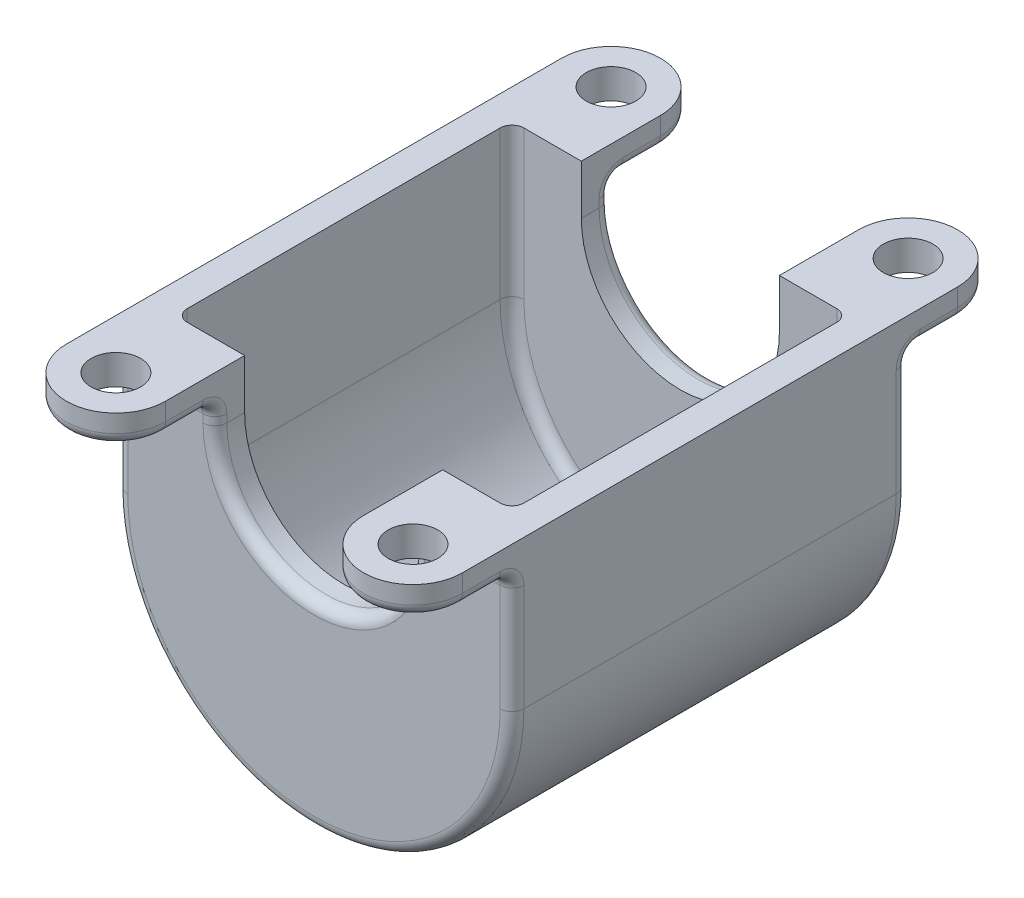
ISO-10303-21;
HEADER;
FILE_DESCRIPTION(('STEP AP214'),'2;1');
FILE_NAME('part.step','',(''),(''),'','','');
FILE_SCHEMA(('AUTOMOTIVE_DESIGN { 1 0 10303 214 1 1 1 1 }'));
ENDSEC;
DATA;
#1=APPLICATION_CONTEXT('core data for automotive mechanical design processes');
#2=APPLICATION_PROTOCOL_DEFINITION('international standard','automotive_design',2000,#1);
#3=PRODUCT_CONTEXT('',#1,'mechanical');
#4=PRODUCT('Part','Part','',(#3));
#5=PRODUCT_RELATED_PRODUCT_CATEGORY('part','',(#4));
#6=PRODUCT_DEFINITION_FORMATION('','',#4);
#7=PRODUCT_DEFINITION_CONTEXT('part definition',#1,'design');
#8=PRODUCT_DEFINITION('design','',#6,#7);
#9=PRODUCT_DEFINITION_SHAPE('','',#8);
#10=(LENGTH_UNIT() NAMED_UNIT(*) SI_UNIT(.MILLI.,.METRE.));
#11=(NAMED_UNIT(*) PLANE_ANGLE_UNIT() SI_UNIT($,.RADIAN.));
#12=(NAMED_UNIT(*) SI_UNIT($,.STERADIAN.) SOLID_ANGLE_UNIT());
#13=UNCERTAINTY_MEASURE_WITH_UNIT(LENGTH_MEASURE(1.E-05),#10,'distance_accuracy_value','');
#14=(GEOMETRIC_REPRESENTATION_CONTEXT(3) GLOBAL_UNCERTAINTY_ASSIGNED_CONTEXT((#13)) GLOBAL_UNIT_ASSIGNED_CONTEXT((#10,
#11,#12)) REPRESENTATION_CONTEXT('',''));
#15=CARTESIAN_POINT('',(0.,0.,0.));
#16=DIRECTION('',(0.,0.,1.));
#17=DIRECTION('',(1.,0.,0.));
#18=AXIS2_PLACEMENT_3D('',#15,#16,#17);
#19=CARTESIAN_POINT('',(0.,-38.1,50.8));
#20=DIRECTION('',(0.,0.,1.));
#21=DIRECTION('',(1.,0.,0.));
#22=AXIS2_PLACEMENT_3D('',#19,#20,#21);
#23=PLANE('',#22);
#24=CARTESIAN_POINT('',(0.,-12.7,50.8));
#25=DIRECTION('',(0.,0.,1.));
#26=DIRECTION('',(1.,0.,0.));
#27=AXIS2_PLACEMENT_3D('',#24,#25,#26);
#28=CIRCLE('',#27,28.448);
#29=CARTESIAN_POINT('',(28.448,-12.7,50.8));
#30=VERTEX_POINT('',#29);
#31=CARTESIAN_POINT('',(-28.448,-12.7,50.8));
#32=VERTEX_POINT('',#31);
#33=EDGE_CURVE('E539',#30,#32,#28,.F.);
#34=ORIENTED_EDGE('',*,*,#33,.T.);
#35=DIRECTION('',(0.,-1.,0.));
#36=VECTOR('',#35,1.);
#37=CARTESIAN_POINT('',(-28.448,-38.1,50.8));
#38=LINE('',#37,#36);
#39=CARTESIAN_POINT('',(-28.448,-10.668,50.8));
#40=VERTEX_POINT('',#39);
#41=EDGE_CURVE('E542',#32,#40,#38,.F.);
#42=ORIENTED_EDGE('',*,*,#41,.T.);
#43=DIRECTION('',(-1.,0.,0.));
#44=VECTOR('',#43,1.);
#45=CARTESIAN_POINT('',(0.,-10.668,50.8));
#46=LINE('',#45,#44);
#47=CARTESIAN_POINT('',(-47.752,-10.668,50.8));
#48=VERTEX_POINT('',#47);
#49=EDGE_CURVE('E496',#40,#48,#46,.T.);
#50=ORIENTED_EDGE('',*,*,#49,.T.);
#51=DIRECTION('',(0.,-1.,0.));
#52=VECTOR('',#51,1.);
#53=CARTESIAN_POINT('',(-47.752,-38.1,50.8));
#54=LINE('',#53,#52);
#55=CARTESIAN_POINT('',(-47.752,-38.1,50.8));
#56=VERTEX_POINT('',#55);
#57=EDGE_CURVE('E535',#48,#56,#54,.T.);
#58=ORIENTED_EDGE('',*,*,#57,.T.);
#59=CARTESIAN_POINT('',(0.,-38.1,50.8));
#60=DIRECTION('',(0.,0.,1.));
#61=DIRECTION('',(1.,0.,0.));
#62=AXIS2_PLACEMENT_3D('',#59,#60,#61);
#63=CIRCLE('',#62,47.752);
#64=CARTESIAN_POINT('',(47.752,-38.1,50.8));
#65=VERTEX_POINT('',#64);
#66=EDGE_CURVE('E531',#56,#65,#63,.T.);
#67=ORIENTED_EDGE('',*,*,#66,.T.);
#68=DIRECTION('',(0.,-1.,0.));
#69=VECTOR('',#68,1.);
#70=CARTESIAN_POINT('',(47.752,-38.1,50.8));
#71=LINE('',#70,#69);
#72=CARTESIAN_POINT('',(47.752,-10.668,50.8));
#73=VERTEX_POINT('',#72);
#74=EDGE_CURVE('E533',#65,#73,#71,.F.);
#75=ORIENTED_EDGE('',*,*,#74,.T.);
#76=DIRECTION('',(-1.,0.,0.));
#77=VECTOR('',#76,1.);
#78=CARTESIAN_POINT('',(0.,-10.668,50.8));
#79=LINE('',#78,#77);
#80=CARTESIAN_POINT('',(28.448,-10.668,50.8));
#81=VERTEX_POINT('',#80);
#82=EDGE_CURVE('E499',#73,#81,#79,.T.);
#83=ORIENTED_EDGE('',*,*,#82,.T.);
#84=DIRECTION('',(0.,-1.,0.));
#85=VECTOR('',#84,1.);
#86=CARTESIAN_POINT('',(28.448,-12.7,50.8));
#87=LINE('',#86,#85);
#88=EDGE_CURVE('E537',#81,#30,#87,.T.);
#89=ORIENTED_EDGE('',*,*,#88,.T.);
#90=EDGE_LOOP('',(#34,#42,#50,#58,#67,#75,#83,#89));
#91=FACE_BOUND('',#90,.T.);
#92=ADVANCED_FACE('F30',(#91),#23,.T.);
#93=CARTESIAN_POINT('',(-25.4,0.,50.8));
#94=DIRECTION('',(0.,-1.,0.));
#95=DIRECTION('',(1.,0.,0.));
#96=AXIS2_PLACEMENT_3D('',#93,#94,#95);
#97=PLANE('',#96);
#98=DIRECTION('',(-1.,0.,0.));
#99=VECTOR('',#98,1.);
#100=CARTESIAN_POINT('',(-25.4,0.,43.18));
#101=LINE('',#100,#99);
#102=CARTESIAN_POINT('',(-25.4,0.,43.18));
#103=VERTEX_POINT('',#102);
#104=CARTESIAN_POINT('',(-40.132,0.,43.18));
#105=VERTEX_POINT('',#104);
#106=EDGE_CURVE('E427',#103,#105,#101,.T.);
#107=ORIENTED_EDGE('',*,*,#106,.T.);
#108=CARTESIAN_POINT('',(-40.132,0.,40.132));
#109=DIRECTION('',(0.,-1.,0.));
#110=DIRECTION('',(1.,0.,0.));
#111=AXIS2_PLACEMENT_3D('',#108,#109,#110);
#112=CIRCLE('',#111,3.048);
#113=CARTESIAN_POINT('',(-43.18,0.,40.132));
#114=VERTEX_POINT('',#113);
#115=EDGE_CURVE('E524',#105,#114,#112,.T.);
#116=ORIENTED_EDGE('',*,*,#115,.T.);
#117=DIRECTION('',(0.,0.,-1.));
#118=VECTOR('',#117,1.);
#119=CARTESIAN_POINT('',(-43.18,0.,50.8));
#120=LINE('',#119,#118);
#121=CARTESIAN_POINT('',(-43.18,0.,-40.132));
#122=VERTEX_POINT('',#121);
#123=EDGE_CURVE('E431',#114,#122,#120,.T.);
#124=ORIENTED_EDGE('',*,*,#123,.T.);
#125=CARTESIAN_POINT('',(-40.132,0.,-40.132));
#126=DIRECTION('',(0.,-1.,0.));
#127=DIRECTION('',(1.,0.,0.));
#128=AXIS2_PLACEMENT_3D('',#125,#126,#127);
#129=CIRCLE('',#128,3.048);
#130=CARTESIAN_POINT('',(-40.132,0.,-43.18));
#131=VERTEX_POINT('',#130);
#132=EDGE_CURVE('E520',#122,#131,#129,.T.);
#133=ORIENTED_EDGE('',*,*,#132,.T.);
#134=DIRECTION('',(-1.,0.,0.));
#135=VECTOR('',#134,1.);
#136=CARTESIAN_POINT('',(-25.4,0.,-43.18));
#137=LINE('',#136,#135);
#138=CARTESIAN_POINT('',(-25.4,0.,-43.18));
#139=VERTEX_POINT('',#138);
#140=EDGE_CURVE('E380',#139,#131,#137,.T.);
#141=ORIENTED_EDGE('',*,*,#140,.F.);
#142=DIRECTION('',(0.,0.,1.));
#143=VECTOR('',#142,1.);
#144=CARTESIAN_POINT('',(-25.4,0.,-50.8));
#145=LINE('',#144,#143);
#146=CARTESIAN_POINT('',(-25.4,0.,-63.5));
#147=VERTEX_POINT('',#146);
#148=EDGE_CURVE('E387',#147,#139,#145,.T.);
#149=ORIENTED_EDGE('',*,*,#148,.F.);
#150=CARTESIAN_POINT('',(-38.1,0.,-63.5));
#151=DIRECTION('',(0.,-1.,0.));
#152=DIRECTION('',(-1.,0.,0.));
#153=AXIS2_PLACEMENT_3D('',#150,#151,#152);
#154=CIRCLE('',#153,12.7);
#155=CARTESIAN_POINT('',(-50.8,0.,-63.5));
#156=VERTEX_POINT('',#155);
#157=EDGE_CURVE('E373',#156,#147,#154,.T.);
#158=ORIENTED_EDGE('',*,*,#157,.F.);
#159=DIRECTION('',(0.,0.,-1.));
#160=VECTOR('',#159,1.);
#161=CARTESIAN_POINT('',(-50.8,0.,50.8));
#162=LINE('',#161,#160);
#163=CARTESIAN_POINT('',(-50.8,0.,63.5));
#164=VERTEX_POINT('',#163);
#165=EDGE_CURVE('E467',#164,#156,#162,.T.);
#166=ORIENTED_EDGE('',*,*,#165,.F.);
#167=CARTESIAN_POINT('',(-38.1,0.,63.5));
#168=DIRECTION('',(0.,1.,0.));
#169=DIRECTION('',(-1.,0.,0.));
#170=AXIS2_PLACEMENT_3D('',#167,#168,#169);
#171=CIRCLE('',#170,12.7);
#172=CARTESIAN_POINT('',(-25.4,0.,63.5));
#173=VERTEX_POINT('',#172);
#174=EDGE_CURVE('E420',#164,#173,#171,.T.);
#175=ORIENTED_EDGE('',*,*,#174,.T.);
#176=DIRECTION('',(0.,0.,-1.));
#177=VECTOR('',#176,1.);
#178=CARTESIAN_POINT('',(-25.4,0.,50.8));
#179=LINE('',#178,#177);
#180=EDGE_CURVE('E438',#173,#103,#179,.T.);
#181=ORIENTED_EDGE('',*,*,#180,.T.);
#182=EDGE_LOOP('',(#107,#116,#124,#133,#141,#149,#158,#166,#175,#181));
#183=FACE_BOUND('',#182,.T.);
#184=CARTESIAN_POINT('',(-38.1,0.,63.5));
#185=DIRECTION('',(0.,1.,0.));
#186=DIRECTION('',(-1.,0.,0.));
#187=AXIS2_PLACEMENT_3D('',#184,#185,#186);
#188=CIRCLE('',#187,6.35);
#189=CARTESIAN_POINT('',(-44.45,0.,63.5));
#190=VERTEX_POINT('',#189);
#191=EDGE_CURVE('E414',#190,#190,#188,.T.);
#192=ORIENTED_EDGE('',*,*,#191,.F.);
#193=EDGE_LOOP('',(#192));
#194=FACE_BOUND('',#193,.T.);
#195=CARTESIAN_POINT('',(-38.1,0.,-63.5));
#196=DIRECTION('',(0.,-1.,0.));
#197=DIRECTION('',(-1.,0.,0.));
#198=AXIS2_PLACEMENT_3D('',#195,#196,#197);
#199=CIRCLE('',#198,6.35);
#200=CARTESIAN_POINT('',(-44.45,0.,-63.5));
#201=VERTEX_POINT('',#200);
#202=EDGE_CURVE('E342',#201,#201,#199,.T.);
#203=ORIENTED_EDGE('',*,*,#202,.T.);
#204=EDGE_LOOP('',(#203));
#205=FACE_BOUND('',#204,.T.);
#206=ADVANCED_FACE('F32',(#183,#194,#205),#97,.F.);
#207=CARTESIAN_POINT('',(-50.8,0.,50.8));
#208=DIRECTION('',(1.,0.,0.));
#209=DIRECTION('',(0.,1.,0.));
#210=AXIS2_PLACEMENT_3D('',#207,#208,#209);
#211=PLANE('',#210);
#212=CARTESIAN_POINT('',(-50.8,-10.668,53.848));
#213=DIRECTION('',(1.,0.,0.));
#214=DIRECTION('',(0.,1.,0.));
#215=AXIS2_PLACEMENT_3D('',#212,#213,#214);
#216=CIRCLE('',#215,6.096);
#217=CARTESIAN_POINT('',(-50.8,-10.668,47.752));
#218=VERTEX_POINT('',#217);
#219=CARTESIAN_POINT('',(-50.8,-4.57199999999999,53.848));
#220=VERTEX_POINT('',#219);
#221=EDGE_CURVE('E640',#218,#220,#216,.T.);
#222=ORIENTED_EDGE('',*,*,#221,.T.);
#223=DIRECTION('',(0.,0.,-1.));
#224=VECTOR('',#223,1.);
#225=CARTESIAN_POINT('',(-50.8,-4.57199999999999,50.8));
#226=LINE('',#225,#224);
#227=CARTESIAN_POINT('',(-50.8,-4.57199999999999,63.5));
#228=VERTEX_POINT('',#227);
#229=EDGE_CURVE('E642',#220,#228,#226,.F.);
#230=ORIENTED_EDGE('',*,*,#229,.T.);
#231=DIRECTION('',(0.,1.,0.));
#232=VECTOR('',#231,1.);
#233=CARTESIAN_POINT('',(-50.8,-7.61999999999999,63.5));
#234=LINE('',#233,#232);
#235=EDGE_CURVE('E423',#228,#164,#234,.T.);
#236=ORIENTED_EDGE('',*,*,#235,.T.);
#237=ORIENTED_EDGE('',*,*,#165,.T.);
#238=DIRECTION('',(0.,1.,0.));
#239=VECTOR('',#238,1.);
#240=CARTESIAN_POINT('',(-50.8,-7.61999999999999,-63.5));
#241=LINE('',#240,#239);
#242=CARTESIAN_POINT('',(-50.8,-4.57199999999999,-63.5));
#243=VERTEX_POINT('',#242);
#244=EDGE_CURVE('E376',#243,#156,#241,.T.);
#245=ORIENTED_EDGE('',*,*,#244,.F.);
#246=DIRECTION('',(0.,0.,1.));
#247=VECTOR('',#246,1.);
#248=CARTESIAN_POINT('',(-50.8,-4.57199999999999,50.8));
#249=LINE('',#248,#247);
#250=CARTESIAN_POINT('',(-50.8,-4.57199999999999,-53.848));
#251=VERTEX_POINT('',#250);
#252=EDGE_CURVE('E636',#243,#251,#249,.T.);
#253=ORIENTED_EDGE('',*,*,#252,.T.);
#254=CARTESIAN_POINT('',(-50.8,-10.668,-53.848));
#255=DIRECTION('',(1.,0.,0.));
#256=DIRECTION('',(0.,1.,0.));
#257=AXIS2_PLACEMENT_3D('',#254,#255,#256);
#258=CIRCLE('',#257,6.096);
#259=CARTESIAN_POINT('',(-50.8,-10.668,-47.752));
#260=VERTEX_POINT('',#259);
#261=EDGE_CURVE('E634',#251,#260,#258,.T.);
#262=ORIENTED_EDGE('',*,*,#261,.T.);
#263=DIRECTION('',(0.,-1.,0.));
#264=VECTOR('',#263,1.);
#265=CARTESIAN_POINT('',(-50.8,-38.1,-47.752));
#266=LINE('',#265,#264);
#267=CARTESIAN_POINT('',(-50.8,-38.1,-47.752));
#268=VERTEX_POINT('',#267);
#269=EDGE_CURVE('E632',#260,#268,#266,.T.);
#270=ORIENTED_EDGE('',*,*,#269,.T.);
#271=DIRECTION('',(0.,0.,-1.));
#272=VECTOR('',#271,1.);
#273=CARTESIAN_POINT('',(-50.8,-38.1,50.8));
#274=LINE('',#273,#272);
#275=CARTESIAN_POINT('',(-50.8,-38.1,47.752));
#276=VERTEX_POINT('',#275);
#277=EDGE_CURVE('E464',#276,#268,#274,.T.);
#278=ORIENTED_EDGE('',*,*,#277,.F.);
#279=DIRECTION('',(0.,-1.,0.));
#280=VECTOR('',#279,1.);
#281=CARTESIAN_POINT('',(-50.8,-10.668,47.752));
#282=LINE('',#281,#280);
#283=EDGE_CURVE('E638',#276,#218,#282,.F.);
#284=ORIENTED_EDGE('',*,*,#283,.T.);
#285=EDGE_LOOP('',(#222,#230,#236,#237,#245,#253,#262,#270,#278,#284));
#286=FACE_BOUND('',#285,.T.);
#287=ADVANCED_FACE('F775',(#286),#211,.F.);
#288=CARTESIAN_POINT('',(0.,-38.1,50.8));
#289=DIRECTION('',(0.,0.,-1.));
#290=DIRECTION('',(-1.,0.,0.));
#291=AXIS2_PLACEMENT_3D('',#288,#289,#290);
#292=CYLINDRICAL_SURFACE('',#291,50.8);
#293=DIRECTION('',(0.,0.,-1.));
#294=VECTOR('',#293,1.);
#295=CARTESIAN_POINT('',(50.8,-38.1,50.8));
#296=LINE('',#295,#294);
#297=CARTESIAN_POINT('',(50.8,-38.1,47.752));
#298=VERTEX_POINT('',#297);
#299=CARTESIAN_POINT('',(50.8,-38.1,-47.752));
#300=VERTEX_POINT('',#299);
#301=EDGE_CURVE('E354',#298,#300,#296,.T.);
#302=ORIENTED_EDGE('',*,*,#301,.F.);
#303=CARTESIAN_POINT('',(0.,-38.1,47.752));
#304=DIRECTION('',(0.,0.,1.));
#305=DIRECTION('',(1.,0.,0.));
#306=AXIS2_PLACEMENT_3D('',#303,#304,#305);
#307=CIRCLE('',#306,50.8);
#308=EDGE_CURVE('E11',#298,#276,#307,.F.);
#309=ORIENTED_EDGE('',*,*,#308,.T.);
#310=ORIENTED_EDGE('',*,*,#277,.T.);
#311=CARTESIAN_POINT('',(0.,-38.1,-47.752));
#312=DIRECTION('',(0.,0.,-1.));
#313=DIRECTION('',(-1.,0.,0.));
#314=AXIS2_PLACEMENT_3D('',#311,#312,#313);
#315=CIRCLE('',#314,50.8);
#316=EDGE_CURVE('E38',#268,#300,#315,.F.);
#317=ORIENTED_EDGE('',*,*,#316,.T.);
#318=EDGE_LOOP('',(#302,#309,#310,#317));
#319=FACE_BOUND('',#318,.T.);
#320=ADVANCED_FACE('F655',(#319),#292,.T.);
#321=CARTESIAN_POINT('',(50.8,0.,50.8));
#322=DIRECTION('',(1.,0.,0.));
#323=DIRECTION('',(0.,1.,0.));
#324=AXIS2_PLACEMENT_3D('',#321,#322,#323);
#325=PLANE('',#324);
#326=DIRECTION('',(0.,1.,0.));
#327=VECTOR('',#326,1.);
#328=CARTESIAN_POINT('',(50.8,-7.61999999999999,63.5));
#329=LINE('',#328,#327);
#330=CARTESIAN_POINT('',(50.8,-4.57199999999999,63.5));
#331=VERTEX_POINT('',#330);
#332=CARTESIAN_POINT('',(50.8,0.,63.5));
#333=VERTEX_POINT('',#332);
#334=EDGE_CURVE('E412',#331,#333,#329,.T.);
#335=ORIENTED_EDGE('',*,*,#334,.F.);
#336=DIRECTION('',(0.,0.,-1.));
#337=VECTOR('',#336,1.);
#338=CARTESIAN_POINT('',(50.8,-4.57199999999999,53.848));
#339=LINE('',#338,#337);
#340=CARTESIAN_POINT('',(50.8,-4.57199999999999,53.848));
#341=VERTEX_POINT('',#340);
#342=EDGE_CURVE('E45',#331,#341,#339,.T.);
#343=ORIENTED_EDGE('',*,*,#342,.T.);
#344=CARTESIAN_POINT('',(50.8,-10.668,53.848));
#345=DIRECTION('',(1.,0.,0.));
#346=DIRECTION('',(0.,1.,0.));
#347=AXIS2_PLACEMENT_3D('',#344,#345,#346);
#348=CIRCLE('',#347,6.096);
#349=CARTESIAN_POINT('',(50.8,-10.668,47.752));
#350=VERTEX_POINT('',#349);
#351=EDGE_CURVE('E49',#341,#350,#348,.F.);
#352=ORIENTED_EDGE('',*,*,#351,.T.);
#353=DIRECTION('',(0.,-1.,0.));
#354=VECTOR('',#353,1.);
#355=CARTESIAN_POINT('',(50.8,0.,47.752));
#356=LINE('',#355,#354);
#357=EDGE_CURVE('E649',#350,#298,#356,.T.);
#358=ORIENTED_EDGE('',*,*,#357,.T.);
#359=ORIENTED_EDGE('',*,*,#301,.T.);
#360=DIRECTION('',(0.,-1.,0.));
#361=VECTOR('',#360,1.);
#362=CARTESIAN_POINT('',(50.8,0.,-47.752));
#363=LINE('',#362,#361);
#364=CARTESIAN_POINT('',(50.8,-10.668,-47.752));
#365=VERTEX_POINT('',#364);
#366=EDGE_CURVE('E644',#300,#365,#363,.F.);
#367=ORIENTED_EDGE('',*,*,#366,.T.);
#368=CARTESIAN_POINT('',(50.8,-10.668,-53.848));
#369=DIRECTION('',(1.,0.,0.));
#370=DIRECTION('',(0.,1.,0.));
#371=AXIS2_PLACEMENT_3D('',#368,#369,#370);
#372=CIRCLE('',#371,6.096);
#373=CARTESIAN_POINT('',(50.8,-4.57199999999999,-53.848));
#374=VERTEX_POINT('',#373);
#375=EDGE_CURVE('E646',#365,#374,#372,.F.);
#376=ORIENTED_EDGE('',*,*,#375,.T.);
#377=DIRECTION('',(0.,0.,1.));
#378=VECTOR('',#377,1.);
#379=CARTESIAN_POINT('',(50.8,-4.57199999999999,-63.5));
#380=LINE('',#379,#378);
#381=CARTESIAN_POINT('',(50.8,-4.57199999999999,-63.5));
#382=VERTEX_POINT('',#381);
#383=EDGE_CURVE('E338',#374,#382,#380,.F.);
#384=ORIENTED_EDGE('',*,*,#383,.T.);
#385=DIRECTION('',(0.,1.,0.));
#386=VECTOR('',#385,1.);
#387=CARTESIAN_POINT('',(50.8,-7.61999999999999,-63.5));
#388=LINE('',#387,#386);
#389=CARTESIAN_POINT('',(50.8,0.,-63.5));
#390=VERTEX_POINT('',#389);
#391=EDGE_CURVE('E332',#382,#390,#388,.T.);
#392=ORIENTED_EDGE('',*,*,#391,.T.);
#393=DIRECTION('',(0.,0.,-1.));
#394=VECTOR('',#393,1.);
#395=CARTESIAN_POINT('',(50.8,0.,50.8));
#396=LINE('',#395,#394);
#397=EDGE_CURVE('E335',#333,#390,#396,.T.);
#398=ORIENTED_EDGE('',*,*,#397,.F.);
#399=EDGE_LOOP('',(#335,#343,#352,#358,#359,#367,#376,#384,#392,#398));
#400=FACE_BOUND('',#399,.T.);
#401=ADVANCED_FACE('F334',(#400),#325,.T.);
#402=CARTESIAN_POINT('',(50.8,0.,50.8));
#403=DIRECTION('',(0.,-1.,0.));
#404=DIRECTION('',(1.,0.,0.));
#405=AXIS2_PLACEMENT_3D('',#402,#403,#404);
#406=PLANE('',#405);
#407=ORIENTED_EDGE('',*,*,#397,.T.);
#408=CARTESIAN_POINT('',(38.1,0.,-63.5));
#409=DIRECTION('',(0.,1.,0.));
#410=DIRECTION('',(1.,0.,0.));
#411=AXIS2_PLACEMENT_3D('',#408,#409,#410);
#412=CIRCLE('',#411,12.7);
#413=CARTESIAN_POINT('',(25.4,0.,-63.5));
#414=VERTEX_POINT('',#413);
#415=EDGE_CURVE('E350',#390,#414,#412,.T.);
#416=ORIENTED_EDGE('',*,*,#415,.T.);
#417=DIRECTION('',(0.,0.,1.));
#418=VECTOR('',#417,1.);
#419=CARTESIAN_POINT('',(25.4,0.,-50.8));
#420=LINE('',#419,#418);
#421=CARTESIAN_POINT('',(25.4,0.,-43.18));
#422=VERTEX_POINT('',#421);
#423=EDGE_CURVE('E401',#414,#422,#420,.T.);
#424=ORIENTED_EDGE('',*,*,#423,.T.);
#425=DIRECTION('',(-1.,0.,0.));
#426=VECTOR('',#425,1.);
#427=CARTESIAN_POINT('',(50.8,0.,-43.18));
#428=LINE('',#427,#426);
#429=CARTESIAN_POINT('',(40.132,0.,-43.18));
#430=VERTEX_POINT('',#429);
#431=EDGE_CURVE('E383',#430,#422,#428,.T.);
#432=ORIENTED_EDGE('',*,*,#431,.F.);
#433=CARTESIAN_POINT('',(40.132,0.,-40.132));
#434=DIRECTION('',(0.,-1.,0.));
#435=DIRECTION('',(1.,0.,0.));
#436=AXIS2_PLACEMENT_3D('',#433,#434,#435);
#437=CIRCLE('',#436,3.048);
#438=CARTESIAN_POINT('',(43.18,0.,-40.132));
#439=VERTEX_POINT('',#438);
#440=EDGE_CURVE('E522',#430,#439,#437,.T.);
#441=ORIENTED_EDGE('',*,*,#440,.T.);
#442=DIRECTION('',(0.,0.,-1.));
#443=VECTOR('',#442,1.);
#444=CARTESIAN_POINT('',(43.18,0.,50.8));
#445=LINE('',#444,#443);
#446=CARTESIAN_POINT('',(43.18,0.,40.132));
#447=VERTEX_POINT('',#446);
#448=EDGE_CURVE('E435',#447,#439,#445,.T.);
#449=ORIENTED_EDGE('',*,*,#448,.F.);
#450=CARTESIAN_POINT('',(40.132,0.,40.132));
#451=DIRECTION('',(0.,-1.,0.));
#452=DIRECTION('',(1.,0.,0.));
#453=AXIS2_PLACEMENT_3D('',#450,#451,#452);
#454=CIRCLE('',#453,3.048);
#455=CARTESIAN_POINT('',(40.132,0.,43.18));
#456=VERTEX_POINT('',#455);
#457=EDGE_CURVE('E526',#447,#456,#454,.T.);
#458=ORIENTED_EDGE('',*,*,#457,.T.);
#459=DIRECTION('',(-1.,0.,0.));
#460=VECTOR('',#459,1.);
#461=CARTESIAN_POINT('',(50.8,0.,43.18));
#462=LINE('',#461,#460);
#463=CARTESIAN_POINT('',(25.4,0.,43.18));
#464=VERTEX_POINT('',#463);
#465=EDGE_CURVE('E441',#456,#464,#462,.T.);
#466=ORIENTED_EDGE('',*,*,#465,.T.);
#467=DIRECTION('',(0.,0.,-1.));
#468=VECTOR('',#467,1.);
#469=CARTESIAN_POINT('',(25.4,0.,50.8));
#470=LINE('',#469,#468);
#471=CARTESIAN_POINT('',(25.4,0.,63.5));
#472=VERTEX_POINT('',#471);
#473=EDGE_CURVE('E355',#472,#464,#470,.T.);
#474=ORIENTED_EDGE('',*,*,#473,.F.);
#475=CARTESIAN_POINT('',(38.1,0.,63.5));
#476=DIRECTION('',(0.,-1.,0.));
#477=DIRECTION('',(1.,0.,0.));
#478=AXIS2_PLACEMENT_3D('',#475,#476,#477);
#479=CIRCLE('',#478,12.7);
#480=EDGE_CURVE('E353',#333,#472,#479,.T.);
#481=ORIENTED_EDGE('',*,*,#480,.F.);
#482=EDGE_LOOP('',(#407,#416,#424,#432,#441,#449,#458,#466,#474,#481));
#483=FACE_BOUND('',#482,.T.);
#484=CARTESIAN_POINT('',(38.1,0.,63.5));
#485=DIRECTION('',(0.,-1.,0.));
#486=DIRECTION('',(1.,0.,0.));
#487=AXIS2_PLACEMENT_3D('',#484,#485,#486);
#488=CIRCLE('',#487,6.35);
#489=CARTESIAN_POINT('',(31.75,0.,63.5));
#490=VERTEX_POINT('',#489);
#491=EDGE_CURVE('E403',#490,#490,#488,.T.);
#492=ORIENTED_EDGE('',*,*,#491,.T.);
#493=EDGE_LOOP('',(#492));
#494=FACE_BOUND('',#493,.T.);
#495=CARTESIAN_POINT('',(38.1,0.,-63.5));
#496=DIRECTION('',(0.,1.,0.));
#497=DIRECTION('',(1.,0.,0.));
#498=AXIS2_PLACEMENT_3D('',#495,#496,#497);
#499=CIRCLE('',#498,6.35);
#500=CARTESIAN_POINT('',(31.75,0.,-63.5));
#501=VERTEX_POINT('',#500);
#502=EDGE_CURVE('E364',#501,#501,#499,.T.);
#503=ORIENTED_EDGE('',*,*,#502,.F.);
#504=EDGE_LOOP('',(#503));
#505=FACE_BOUND('',#504,.T.);
#506=ADVANCED_FACE('F347',(#483,#494,#505),#406,.F.);
#507=CARTESIAN_POINT('',(25.4,0.,50.8));
#508=DIRECTION('',(1.,0.,0.));
#509=DIRECTION('',(0.,1.,0.));
#510=AXIS2_PLACEMENT_3D('',#507,#508,#509);
#511=PLANE('',#510);
#512=DIRECTION('',(0.,0.,-1.));
#513=VECTOR('',#512,1.);
#514=CARTESIAN_POINT('',(25.4,-12.7,50.8));
#515=LINE('',#514,#513);
#516=CARTESIAN_POINT('',(25.4,-12.7,47.752));
#517=VERTEX_POINT('',#516);
#518=CARTESIAN_POINT('',(25.4,-12.7,43.18));
#519=VERTEX_POINT('',#518);
#520=EDGE_CURVE('E458',#517,#519,#515,.T.);
#521=ORIENTED_EDGE('',*,*,#520,.F.);
#522=DIRECTION('',(0.,-1.,0.));
#523=VECTOR('',#522,1.);
#524=CARTESIAN_POINT('',(25.4,-10.668,47.752));
#525=LINE('',#524,#523);
#526=CARTESIAN_POINT('',(25.4,-10.668,47.752));
#527=VERTEX_POINT('',#526);
#528=EDGE_CURVE('E570',#517,#527,#525,.F.);
#529=ORIENTED_EDGE('',*,*,#528,.T.);
#530=CARTESIAN_POINT('',(25.4,-10.668,53.848));
#531=DIRECTION('',(1.,0.,0.));
#532=DIRECTION('',(0.,1.,0.));
#533=AXIS2_PLACEMENT_3D('',#530,#531,#532);
#534=CIRCLE('',#533,6.096);
#535=CARTESIAN_POINT('',(25.4,-4.57199999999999,53.848));
#536=VERTEX_POINT('',#535);
#537=EDGE_CURVE('E568',#527,#536,#534,.T.);
#538=ORIENTED_EDGE('',*,*,#537,.T.);
#539=DIRECTION('',(0.,0.,1.));
#540=VECTOR('',#539,1.);
#541=CARTESIAN_POINT('',(25.4,-4.57199999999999,50.8));
#542=LINE('',#541,#540);
#543=CARTESIAN_POINT('',(25.4,-4.572,63.5));
#544=VERTEX_POINT('',#543);
#545=EDGE_CURVE('E566',#536,#544,#542,.T.);
#546=ORIENTED_EDGE('',*,*,#545,.T.);
#547=DIRECTION('',(0.,1.,0.));
#548=VECTOR('',#547,1.);
#549=CARTESIAN_POINT('',(25.4,-7.62,63.5));
#550=LINE('',#549,#548);
#551=EDGE_CURVE('E410',#544,#472,#550,.T.);
#552=ORIENTED_EDGE('',*,*,#551,.T.);
#553=ORIENTED_EDGE('',*,*,#473,.T.);
#554=DIRECTION('',(0.,-1.,0.));
#555=VECTOR('',#554,1.);
#556=CARTESIAN_POINT('',(25.4,0.,43.18));
#557=LINE('',#556,#555);
#558=EDGE_CURVE('E448',#464,#519,#557,.T.);
#559=ORIENTED_EDGE('',*,*,#558,.T.);
#560=EDGE_LOOP('',(#521,#529,#538,#546,#552,#553,#559));
#561=FACE_BOUND('',#560,.T.);
#562=ADVANCED_FACE('F759',(#561),#511,.F.);
#563=CARTESIAN_POINT('',(0.,-12.7,50.8));
#564=DIRECTION('',(0.,0.,-1.));
#565=DIRECTION('',(-1.,0.,0.));
#566=AXIS2_PLACEMENT_3D('',#563,#564,#565);
#567=CYLINDRICAL_SURFACE('',#566,25.4);
#568=DIRECTION('',(0.,0.,-1.));
#569=VECTOR('',#568,1.);
#570=CARTESIAN_POINT('',(-25.4,-12.7,50.8));
#571=LINE('',#570,#569);
#572=CARTESIAN_POINT('',(-25.4,-12.7,47.752));
#573=VERTEX_POINT('',#572);
#574=CARTESIAN_POINT('',(-25.4,-12.7,43.18));
#575=VERTEX_POINT('',#574);
#576=EDGE_CURVE('E456',#573,#575,#571,.T.);
#577=ORIENTED_EDGE('',*,*,#576,.F.);
#578=CARTESIAN_POINT('',(0.,-12.7,47.752));
#579=DIRECTION('',(0.,0.,1.));
#580=DIRECTION('',(1.,0.,0.));
#581=AXIS2_PLACEMENT_3D('',#578,#579,#580);
#582=CIRCLE('',#581,25.4);
#583=EDGE_CURVE('E528',#573,#517,#582,.T.);
#584=ORIENTED_EDGE('',*,*,#583,.T.);
#585=ORIENTED_EDGE('',*,*,#520,.T.);
#586=CARTESIAN_POINT('',(0.,-12.7,43.18));
#587=DIRECTION('',(0.,0.,1.));
#588=DIRECTION('',(1.,0.,0.));
#589=AXIS2_PLACEMENT_3D('',#586,#587,#588);
#590=CIRCLE('',#589,25.4);
#591=EDGE_CURVE('E445',#575,#519,#590,.T.);
#592=ORIENTED_EDGE('',*,*,#591,.F.);
#593=EDGE_LOOP('',(#577,#584,#585,#592));
#594=FACE_BOUND('',#593,.T.);
#595=ADVANCED_FACE('F765',(#594),#567,.F.);
#596=CARTESIAN_POINT('',(-25.4,0.,50.8));
#597=DIRECTION('',(1.,0.,0.));
#598=DIRECTION('',(0.,1.,0.));
#599=AXIS2_PLACEMENT_3D('',#596,#597,#598);
#600=PLANE('',#599);
#601=CARTESIAN_POINT('',(-25.4,-10.668,53.848));
#602=DIRECTION('',(1.,0.,0.));
#603=DIRECTION('',(0.,1.,0.));
#604=AXIS2_PLACEMENT_3D('',#601,#602,#603);
#605=CIRCLE('',#604,6.096);
#606=CARTESIAN_POINT('',(-25.4,-4.57199999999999,53.848));
#607=VERTEX_POINT('',#606);
#608=CARTESIAN_POINT('',(-25.4,-10.668,47.752));
#609=VERTEX_POINT('',#608);
#610=EDGE_CURVE('E562',#607,#609,#605,.F.);
#611=ORIENTED_EDGE('',*,*,#610,.T.);
#612=DIRECTION('',(0.,-1.,0.));
#613=VECTOR('',#612,1.);
#614=CARTESIAN_POINT('',(-25.4,0.,47.752));
#615=LINE('',#614,#613);
#616=EDGE_CURVE('E564',#609,#573,#615,.T.);
#617=ORIENTED_EDGE('',*,*,#616,.T.);
#618=ORIENTED_EDGE('',*,*,#576,.T.);
#619=DIRECTION('',(0.,-1.,0.));
#620=VECTOR('',#619,1.);
#621=CARTESIAN_POINT('',(-25.4,0.,43.18));
#622=LINE('',#621,#620);
#623=EDGE_CURVE('E442',#103,#575,#622,.T.);
#624=ORIENTED_EDGE('',*,*,#623,.F.);
#625=ORIENTED_EDGE('',*,*,#180,.F.);
#626=DIRECTION('',(0.,1.,0.));
#627=VECTOR('',#626,1.);
#628=CARTESIAN_POINT('',(-25.4,-7.62,63.5));
#629=LINE('',#628,#627);
#630=CARTESIAN_POINT('',(-25.4,-4.572,63.5));
#631=VERTEX_POINT('',#630);
#632=EDGE_CURVE('E425',#631,#173,#629,.T.);
#633=ORIENTED_EDGE('',*,*,#632,.F.);
#634=DIRECTION('',(0.,0.,1.));
#635=VECTOR('',#634,1.);
#636=CARTESIAN_POINT('',(-25.4,-4.57199999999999,53.848));
#637=LINE('',#636,#635);
#638=EDGE_CURVE('E560',#631,#607,#637,.F.);
#639=ORIENTED_EDGE('',*,*,#638,.T.);
#640=EDGE_LOOP('',(#611,#617,#618,#624,#625,#633,#639));
#641=FACE_BOUND('',#640,.T.);
#642=ADVANCED_FACE('F781',(#641),#600,.T.);
#643=CARTESIAN_POINT('',(-43.18,0.,50.8));
#644=DIRECTION('',(1.,0.,0.));
#645=DIRECTION('',(0.,1.,0.));
#646=AXIS2_PLACEMENT_3D('',#643,#644,#645);
#647=PLANE('',#646);
#648=DIRECTION('',(0.,0.,-1.));
#649=VECTOR('',#648,1.);
#650=CARTESIAN_POINT('',(-43.18,-38.1,50.8));
#651=LINE('',#650,#649);
#652=CARTESIAN_POINT('',(-43.18,-38.1,40.132));
#653=VERTEX_POINT('',#652);
#654=CARTESIAN_POINT('',(-43.18,-38.1,-40.132));
#655=VERTEX_POINT('',#654);
#656=EDGE_CURVE('E428',#653,#655,#651,.T.);
#657=ORIENTED_EDGE('',*,*,#656,.T.);
#658=DIRECTION('',(0.,-1.,0.));
#659=VECTOR('',#658,1.);
#660=CARTESIAN_POINT('',(-43.18,0.,-40.132));
#661=LINE('',#660,#659);
#662=EDGE_CURVE('E480',#655,#122,#661,.F.);
#663=ORIENTED_EDGE('',*,*,#662,.T.);
#664=ORIENTED_EDGE('',*,*,#123,.F.);
#665=DIRECTION('',(0.,-1.,0.));
#666=VECTOR('',#665,1.);
#667=CARTESIAN_POINT('',(-43.18,0.,40.132));
#668=LINE('',#667,#666);
#669=EDGE_CURVE('E477',#114,#653,#668,.T.);
#670=ORIENTED_EDGE('',*,*,#669,.T.);
#671=EDGE_LOOP('',(#657,#663,#664,#670));
#672=FACE_BOUND('',#671,.T.);
#673=ADVANCED_FACE('F737',(#672),#647,.T.);
#674=CARTESIAN_POINT('',(0.,-38.1,50.8));
#675=DIRECTION('',(0.,0.,-1.));
#676=DIRECTION('',(-1.,0.,0.));
#677=AXIS2_PLACEMENT_3D('',#674,#675,#676);
#678=CYLINDRICAL_SURFACE('',#677,43.18);
#679=DIRECTION('',(0.,0.,1.));
#680=VECTOR('',#679,1.);
#681=CARTESIAN_POINT('',(43.18,-38.1,50.8));
#682=LINE('',#681,#680);
#683=CARTESIAN_POINT('',(43.18,-38.1,40.132));
#684=VERTEX_POINT('',#683);
#685=CARTESIAN_POINT('',(43.18,-38.1,-40.132));
#686=VERTEX_POINT('',#685);
#687=EDGE_CURVE('E432',#684,#686,#682,.F.);
#688=ORIENTED_EDGE('',*,*,#687,.T.);
#689=CARTESIAN_POINT('',(0.,-38.1,-40.132));
#690=DIRECTION('',(0.,0.,-1.));
#691=DIRECTION('',(-1.,0.,0.));
#692=AXIS2_PLACEMENT_3D('',#689,#690,#691);
#693=CIRCLE('',#692,43.18);
#694=EDGE_CURVE('E494',#686,#655,#693,.T.);
#695=ORIENTED_EDGE('',*,*,#694,.T.);
#696=ORIENTED_EDGE('',*,*,#656,.F.);
#697=CARTESIAN_POINT('',(0.,-38.1,40.132));
#698=DIRECTION('',(0.,0.,1.));
#699=DIRECTION('',(1.,0.,0.));
#700=AXIS2_PLACEMENT_3D('',#697,#698,#699);
#701=CIRCLE('',#700,43.18);
#702=EDGE_CURVE('E492',#653,#684,#701,.T.);
#703=ORIENTED_EDGE('',*,*,#702,.T.);
#704=EDGE_LOOP('',(#688,#695,#696,#703));
#705=FACE_BOUND('',#704,.T.);
#706=ADVANCED_FACE('F723',(#705),#678,.F.);
#707=CARTESIAN_POINT('',(43.18,0.,50.8));
#708=DIRECTION('',(1.,0.,0.));
#709=DIRECTION('',(0.,1.,0.));
#710=AXIS2_PLACEMENT_3D('',#707,#708,#709);
#711=PLANE('',#710);
#712=ORIENTED_EDGE('',*,*,#448,.T.);
#713=DIRECTION('',(0.,-1.,0.));
#714=VECTOR('',#713,1.);
#715=CARTESIAN_POINT('',(43.18,-38.1,-40.132));
#716=LINE('',#715,#714);
#717=EDGE_CURVE('E484',#439,#686,#716,.T.);
#718=ORIENTED_EDGE('',*,*,#717,.T.);
#719=ORIENTED_EDGE('',*,*,#687,.F.);
#720=DIRECTION('',(0.,-1.,0.));
#721=VECTOR('',#720,1.);
#722=CARTESIAN_POINT('',(43.18,0.,40.132));
#723=LINE('',#722,#721);
#724=EDGE_CURVE('E482',#684,#447,#723,.F.);
#725=ORIENTED_EDGE('',*,*,#724,.T.);
#726=EDGE_LOOP('',(#712,#718,#719,#725));
#727=FACE_BOUND('',#726,.T.);
#728=ADVANCED_FACE('F720',(#727),#711,.F.);
#729=CARTESIAN_POINT('',(0.,-38.1,43.18));
#730=DIRECTION('',(0.,0.,1.));
#731=DIRECTION('',(1.,0.,0.));
#732=AXIS2_PLACEMENT_3D('',#729,#730,#731);
#733=PLANE('',#732);
#734=CARTESIAN_POINT('',(0.,-38.1,43.18));
#735=DIRECTION('',(0.,0.,1.));
#736=DIRECTION('',(1.,0.,0.));
#737=AXIS2_PLACEMENT_3D('',#734,#735,#736);
#738=CIRCLE('',#737,40.132);
#739=CARTESIAN_POINT('',(40.132,-38.1,43.18));
#740=VERTEX_POINT('',#739);
#741=CARTESIAN_POINT('',(-40.132,-38.1,43.18));
#742=VERTEX_POINT('',#741);
#743=EDGE_CURVE('E486',#740,#742,#738,.F.);
#744=ORIENTED_EDGE('',*,*,#743,.T.);
#745=DIRECTION('',(0.,-1.,0.));
#746=VECTOR('',#745,1.);
#747=CARTESIAN_POINT('',(-40.132,-38.1,43.18));
#748=LINE('',#747,#746);
#749=EDGE_CURVE('E490',#742,#105,#748,.F.);
#750=ORIENTED_EDGE('',*,*,#749,.T.);
#751=ORIENTED_EDGE('',*,*,#106,.F.);
#752=ORIENTED_EDGE('',*,*,#623,.T.);
#753=ORIENTED_EDGE('',*,*,#591,.T.);
#754=ORIENTED_EDGE('',*,*,#558,.F.);
#755=ORIENTED_EDGE('',*,*,#465,.F.);
#756=DIRECTION('',(0.,-1.,0.));
#757=VECTOR('',#756,1.);
#758=CARTESIAN_POINT('',(40.132,-38.1,43.18));
#759=LINE('',#758,#757);
#760=EDGE_CURVE('E488',#456,#740,#759,.T.);
#761=ORIENTED_EDGE('',*,*,#760,.T.);
#762=EDGE_LOOP('',(#744,#750,#751,#752,#753,#754,#755,#761));
#763=FACE_BOUND('',#762,.T.);
#764=ADVANCED_FACE('F779',(#763),#733,.F.);
#765=CARTESIAN_POINT('',(-38.1,-7.61999999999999,63.5));
#766=DIRECTION('',(0.,1.,0.));
#767=DIRECTION('',(-1.,0.,0.));
#768=AXIS2_PLACEMENT_3D('',#765,#766,#767);
#769=CYLINDRICAL_SURFACE('',#768,12.7);
#770=ORIENTED_EDGE('',*,*,#235,.F.);
#771=CARTESIAN_POINT('',(-38.1,-4.57199999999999,63.5));
#772=DIRECTION('',(0.,1.,0.));
#773=DIRECTION('',(-1.,0.,0.));
#774=AXIS2_PLACEMENT_3D('',#771,#772,#773);
#775=CIRCLE('',#774,12.7);
#776=EDGE_CURVE('E624',#228,#631,#775,.T.);
#777=ORIENTED_EDGE('',*,*,#776,.T.);
#778=ORIENTED_EDGE('',*,*,#632,.T.);
#779=ORIENTED_EDGE('',*,*,#174,.F.);
#780=EDGE_LOOP('',(#770,#777,#778,#779));
#781=FACE_BOUND('',#780,.T.);
#782=ADVANCED_FACE('F975',(#781),#769,.T.);
#783=CARTESIAN_POINT('',(-38.1,-7.61999999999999,63.5));
#784=DIRECTION('',(0.,1.,0.));
#785=DIRECTION('',(-1.,0.,0.));
#786=AXIS2_PLACEMENT_3D('',#783,#784,#785);
#787=PLANE('',#786);
#788=DIRECTION('',(-1.,0.,0.));
#789=VECTOR('',#788,1.);
#790=CARTESIAN_POINT('',(-38.1,-7.61999999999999,53.848));
#791=LINE('',#790,#789);
#792=CARTESIAN_POINT('',(-47.752,-7.61999999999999,53.848));
#793=VERTEX_POINT('',#792);
#794=CARTESIAN_POINT('',(-28.448,-7.62,53.848));
#795=VERTEX_POINT('',#794);
#796=EDGE_CURVE('E505',#793,#795,#791,.F.);
#797=ORIENTED_EDGE('',*,*,#796,.T.);
#798=DIRECTION('',(0.,0.,1.));
#799=VECTOR('',#798,1.);
#800=CARTESIAN_POINT('',(-28.448,-7.62,63.5));
#801=LINE('',#800,#799);
#802=CARTESIAN_POINT('',(-28.448,-7.62,63.5));
#803=VERTEX_POINT('',#802);
#804=EDGE_CURVE('E604',#795,#803,#801,.T.);
#805=ORIENTED_EDGE('',*,*,#804,.T.);
#806=CARTESIAN_POINT('',(-38.1,-7.61999999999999,63.5));
#807=DIRECTION('',(0.,1.,0.));
#808=DIRECTION('',(-1.,0.,0.));
#809=AXIS2_PLACEMENT_3D('',#806,#807,#808);
#810=CIRCLE('',#809,9.652);
#811=CARTESIAN_POINT('',(-47.752,-7.61999999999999,63.5));
#812=VERTEX_POINT('',#811);
#813=EDGE_CURVE('E602',#803,#812,#810,.F.);
#814=ORIENTED_EDGE('',*,*,#813,.T.);
#815=DIRECTION('',(0.,0.,-1.));
#816=VECTOR('',#815,1.);
#817=CARTESIAN_POINT('',(-47.752,-7.61999999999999,63.5));
#818=LINE('',#817,#816);
#819=EDGE_CURVE('E600',#812,#793,#818,.T.);
#820=ORIENTED_EDGE('',*,*,#819,.T.);
#821=EDGE_LOOP('',(#797,#805,#814,#820));
#822=FACE_BOUND('',#821,.T.);
#823=CARTESIAN_POINT('',(-38.1,-7.61999999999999,63.5));
#824=DIRECTION('',(0.,1.,0.));
#825=DIRECTION('',(-1.,0.,0.));
#826=AXIS2_PLACEMENT_3D('',#823,#824,#825);
#827=CIRCLE('',#826,6.35);
#828=CARTESIAN_POINT('',(-44.45,-7.61999999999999,63.5));
#829=VERTEX_POINT('',#828);
#830=EDGE_CURVE('E417',#829,#829,#827,.T.);
#831=ORIENTED_EDGE('',*,*,#830,.T.);
#832=EDGE_LOOP('',(#831));
#833=FACE_BOUND('',#832,.T.);
#834=ADVANCED_FACE('F971',(#822,#833),#787,.F.);
#835=CARTESIAN_POINT('',(-38.1,-7.61999999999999,63.5));
#836=DIRECTION('',(0.,1.,0.));
#837=DIRECTION('',(-1.,0.,0.));
#838=AXIS2_PLACEMENT_3D('',#835,#836,#837);
#839=CYLINDRICAL_SURFACE('',#838,6.35);
#840=CARTESIAN_POINT('',(-44.45,-7.61999999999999,63.5));
#841=CARTESIAN_POINT('',(-44.45,-7.54062499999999,63.5));
#842=CARTESIAN_POINT('',(-44.45,-7.46124999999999,63.5));
#843=CARTESIAN_POINT('',(-44.45,-7.30249999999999,63.5));
#844=CARTESIAN_POINT('',(-44.45,-7.22312499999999,63.5));
#845=CARTESIAN_POINT('',(-44.45,-7.06437499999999,63.5));
#846=CARTESIAN_POINT('',(-44.45,-6.98499999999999,63.5));
#847=CARTESIAN_POINT('',(-44.45,-6.82624999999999,63.5));
#848=CARTESIAN_POINT('',(-44.45,-6.74687499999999,63.5));
#849=CARTESIAN_POINT('',(-44.45,-6.58812499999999,63.5));
#850=CARTESIAN_POINT('',(-44.45,-6.50874999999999,63.5));
#851=CARTESIAN_POINT('',(-44.45,-6.34999999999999,63.5));
#852=CARTESIAN_POINT('',(-44.45,-6.27062499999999,63.5));
#853=CARTESIAN_POINT('',(-44.45,-6.111875,63.5));
#854=CARTESIAN_POINT('',(-44.45,-6.03249999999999,63.5));
#855=CARTESIAN_POINT('',(-44.45,-5.87374999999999,63.5));
#856=CARTESIAN_POINT('',(-44.45,-5.794375,63.5));
#857=CARTESIAN_POINT('',(-44.45,-5.63562499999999,63.5));
#858=CARTESIAN_POINT('',(-44.45,-5.55624999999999,63.5));
#859=CARTESIAN_POINT('',(-44.45,-5.3975,63.5));
#860=CARTESIAN_POINT('',(-44.45,-5.31812499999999,63.5));
#861=CARTESIAN_POINT('',(-44.45,-5.15937499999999,63.5));
#862=CARTESIAN_POINT('',(-44.45,-5.07999999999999,63.5));
#863=CARTESIAN_POINT('',(-44.45,-4.92125,63.5));
#864=CARTESIAN_POINT('',(-44.45,-4.84187499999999,63.5));
#865=CARTESIAN_POINT('',(-44.45,-4.683125,63.5));
#866=CARTESIAN_POINT('',(-44.45,-4.60375,63.5));
#867=CARTESIAN_POINT('',(-44.45,-4.44499999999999,63.5));
#868=CARTESIAN_POINT('',(-44.45,-4.365625,63.5));
#869=CARTESIAN_POINT('',(-44.45,-4.20687499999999,63.5));
#870=CARTESIAN_POINT('',(-44.45,-4.1275,63.5));
#871=CARTESIAN_POINT('',(-44.45,-3.96874999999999,63.5));
#872=CARTESIAN_POINT('',(-44.45,-3.88937499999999,63.5));
#873=CARTESIAN_POINT('',(-44.45,-3.73062499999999,63.5));
#874=CARTESIAN_POINT('',(-44.45,-3.65125,63.5));
#875=CARTESIAN_POINT('',(-44.45,-3.4925,63.5));
#876=CARTESIAN_POINT('',(-44.45,-3.41312499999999,63.5));
#877=CARTESIAN_POINT('',(-44.45,-3.25437499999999,63.5));
#878=CARTESIAN_POINT('',(-44.45,-3.17499999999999,63.5));
#879=CARTESIAN_POINT('',(-44.45,-3.01624999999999,63.5));
#880=CARTESIAN_POINT('',(-44.45,-2.93687499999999,63.5));
#881=CARTESIAN_POINT('',(-44.45,-2.77812499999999,63.5));
#882=CARTESIAN_POINT('',(-44.45,-2.69875,63.5));
#883=CARTESIAN_POINT('',(-44.45,-2.54,63.5));
#884=CARTESIAN_POINT('',(-44.45,-2.46062499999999,63.5));
#885=CARTESIAN_POINT('',(-44.45,-2.30187499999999,63.5));
#886=CARTESIAN_POINT('',(-44.45,-2.22249999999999,63.5));
#887=CARTESIAN_POINT('',(-44.45,-2.06374999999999,63.5));
#888=CARTESIAN_POINT('',(-44.45,-1.984375,63.5));
#889=CARTESIAN_POINT('',(-44.45,-1.82562499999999,63.5));
#890=CARTESIAN_POINT('',(-44.45,-1.74624999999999,63.5));
#891=CARTESIAN_POINT('',(-44.45,-1.5875,63.5));
#892=CARTESIAN_POINT('',(-44.45,-1.508125,63.5));
#893=CARTESIAN_POINT('',(-44.45,-1.34937499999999,63.5));
#894=CARTESIAN_POINT('',(-44.45,-1.26999999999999,63.5));
#895=CARTESIAN_POINT('',(-44.45,-1.11124999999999,63.5));
#896=CARTESIAN_POINT('',(-44.45,-1.03187499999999,63.5));
#897=CARTESIAN_POINT('',(-44.45,-0.873124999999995,63.5));
#898=CARTESIAN_POINT('',(-44.45,-0.793749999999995,63.5));
#899=CARTESIAN_POINT('',(-44.45,-0.634999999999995,63.5));
#900=CARTESIAN_POINT('',(-44.45,-0.555624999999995,63.5));
#901=CARTESIAN_POINT('',(-44.45,-0.396874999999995,63.5));
#902=CARTESIAN_POINT('',(-44.45,-0.317499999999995,63.5));
#903=CARTESIAN_POINT('',(-44.45,-0.158749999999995,63.5));
#904=CARTESIAN_POINT('',(-44.45,-0.0793749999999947,63.5));
#905=CARTESIAN_POINT('',(-44.45,0.,63.5));
#906=B_SPLINE_CURVE_WITH_KNOTS('',3,(#840,#841,#842,#843,#844,#845,#846,#847,#848,#849,#850,
#851,#852,#853,#854,#855,#856,#857,#858,#859,#860,#861,#862,#863,#864,#865,#866,#867,#868,#869,
#870,#871,#872,#873,#874,#875,#876,#877,#878,#879,#880,#881,#882,#883,#884,#885,#886,#887,#888,
#889,#890,#891,#892,#893,#894,#895,#896,#897,#898,#899,#900,#901,#902,#903,#904,#905),
.UNSPECIFIED.,.F.,.F.,(4,2,2,2,2,2,2,2,2,2,2,2,2,2,2,2,2,2,2,2,2,2,2,2,2,2,2,2,2,2,2,2,4),(0.,
0.238125,0.476249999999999,0.714375,0.952499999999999,1.190625,1.42875,1.666875,1.905,2.143125,
2.38125,2.619375,2.8575,3.095625,3.33375,3.571875,3.81,4.048125,4.28625,4.524375,4.7625,
5.000625,5.23875,5.476875,5.715,5.953125,6.19125,6.429375,6.6675,6.905625,7.14375,7.381875,
7.62),.UNSPECIFIED.);
#907=EDGE_CURVE('BSEAM964',#829,#190,#906,.T.);
#908=ORIENTED_EDGE('',*,*,#830,.F.);
#909=ORIENTED_EDGE('',*,*,#191,.T.);
#910=ORIENTED_EDGE('',*,*,#907,.T.);
#911=ORIENTED_EDGE('',*,*,#907,.F.);
#912=EDGE_LOOP('',(#908,#910,#909,#911));
#913=FACE_BOUND('',#912,.T.);
#914=ADVANCED_FACE('F964',(#913),#839,.F.);
#915=CARTESIAN_POINT('',(38.1,-7.61999999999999,63.5));
#916=DIRECTION('',(0.,1.,0.));
#917=DIRECTION('',(1.,0.,0.));
#918=AXIS2_PLACEMENT_3D('',#915,#916,#917);
#919=PLANE('',#918);
#920=CARTESIAN_POINT('',(38.1,-7.61999999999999,63.5));
#921=DIRECTION('',(0.,1.,0.));
#922=DIRECTION('',(-1.,0.,0.));
#923=AXIS2_PLACEMENT_3D('',#920,#921,#922);
#924=CIRCLE('',#923,9.652);
#925=CARTESIAN_POINT('',(47.752,-7.61999999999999,63.5));
#926=VERTEX_POINT('',#925);
#927=CARTESIAN_POINT('',(28.448,-7.62,63.5));
#928=VERTEX_POINT('',#927);
#929=EDGE_CURVE('E608',#926,#928,#924,.F.);
#930=ORIENTED_EDGE('',*,*,#929,.T.);
#931=DIRECTION('',(0.,0.,1.));
#932=VECTOR('',#931,1.);
#933=CARTESIAN_POINT('',(28.448,-7.62,63.5));
#934=LINE('',#933,#932);
#935=CARTESIAN_POINT('',(28.448,-7.62,53.848));
#936=VERTEX_POINT('',#935);
#937=EDGE_CURVE('E610',#928,#936,#934,.F.);
#938=ORIENTED_EDGE('',*,*,#937,.T.);
#939=DIRECTION('',(-1.,0.,0.));
#940=VECTOR('',#939,1.);
#941=CARTESIAN_POINT('',(38.1,-7.61999999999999,53.848));
#942=LINE('',#941,#940);
#943=CARTESIAN_POINT('',(47.752,-7.61999999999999,53.848));
#944=VERTEX_POINT('',#943);
#945=EDGE_CURVE('E502',#936,#944,#942,.F.);
#946=ORIENTED_EDGE('',*,*,#945,.T.);
#947=DIRECTION('',(0.,0.,-1.));
#948=VECTOR('',#947,1.);
#949=CARTESIAN_POINT('',(47.752,-7.61999999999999,63.5));
#950=LINE('',#949,#948);
#951=EDGE_CURVE('E606',#944,#926,#950,.F.);
#952=ORIENTED_EDGE('',*,*,#951,.T.);
#953=EDGE_LOOP('',(#930,#938,#946,#952));
#954=FACE_BOUND('',#953,.T.);
#955=CARTESIAN_POINT('',(38.1,-7.61999999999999,63.5));
#956=DIRECTION('',(0.,-1.,0.));
#957=DIRECTION('',(1.,0.,0.));
#958=AXIS2_PLACEMENT_3D('',#955,#956,#957);
#959=CIRCLE('',#958,6.35);
#960=CARTESIAN_POINT('',(31.75,-7.61999999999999,63.5));
#961=VERTEX_POINT('',#960);
#962=EDGE_CURVE('E406',#961,#961,#959,.T.);
#963=ORIENTED_EDGE('',*,*,#962,.F.);
#964=EDGE_LOOP('',(#963));
#965=FACE_BOUND('',#964,.T.);
#966=ADVANCED_FACE('F961',(#954,#965),#919,.F.);
#967=CARTESIAN_POINT('',(38.1,-7.61999999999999,63.5));
#968=DIRECTION('',(0.,1.,0.));
#969=DIRECTION('',(-1.,0.,0.));
#970=AXIS2_PLACEMENT_3D('',#967,#968,#969);
#971=CYLINDRICAL_SURFACE('',#970,12.7);
#972=ORIENTED_EDGE('',*,*,#551,.F.);
#973=CARTESIAN_POINT('',(38.1,-4.57199999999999,63.5));
#974=DIRECTION('',(0.,1.,0.));
#975=DIRECTION('',(-1.,0.,0.));
#976=AXIS2_PLACEMENT_3D('',#973,#974,#975);
#977=CIRCLE('',#976,12.7);
#978=EDGE_CURVE('E626',#544,#331,#977,.T.);
#979=ORIENTED_EDGE('',*,*,#978,.T.);
#980=ORIENTED_EDGE('',*,*,#334,.T.);
#981=ORIENTED_EDGE('',*,*,#480,.T.);
#982=EDGE_LOOP('',(#972,#979,#980,#981));
#983=FACE_BOUND('',#982,.T.);
#984=ADVANCED_FACE('F959',(#983),#971,.T.);
#985=CARTESIAN_POINT('',(38.1,-7.61999999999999,63.5));
#986=DIRECTION('',(0.,1.,0.));
#987=DIRECTION('',(-1.,0.,0.));
#988=AXIS2_PLACEMENT_3D('',#985,#986,#987);
#989=CYLINDRICAL_SURFACE('',#988,6.35);
#990=CARTESIAN_POINT('',(31.75,-7.61999999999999,63.5));
#991=CARTESIAN_POINT('',(31.75,-7.540625,63.5));
#992=CARTESIAN_POINT('',(31.75,-7.46124999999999,63.5));
#993=CARTESIAN_POINT('',(31.75,-7.3025,63.5));
#994=CARTESIAN_POINT('',(31.75,-7.223125,63.5));
#995=CARTESIAN_POINT('',(31.75,-7.06437499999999,63.5));
#996=CARTESIAN_POINT('',(31.75,-6.985,63.5));
#997=CARTESIAN_POINT('',(31.75,-6.82625,63.5));
#998=CARTESIAN_POINT('',(31.75,-6.74687499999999,63.5));
#999=CARTESIAN_POINT('',(31.75,-6.588125,63.5));
#1000=CARTESIAN_POINT('',(31.75,-6.50875,63.5));
#1001=CARTESIAN_POINT('',(31.75,-6.35,63.5));
#1002=CARTESIAN_POINT('',(31.75,-6.270625,63.5));
#1003=CARTESIAN_POINT('',(31.75,-6.111875,63.5));
#1004=CARTESIAN_POINT('',(31.75,-6.0325,63.5));
#1005=CARTESIAN_POINT('',(31.75,-5.87375,63.5));
#1006=CARTESIAN_POINT('',(31.75,-5.794375,63.5));
#1007=CARTESIAN_POINT('',(31.75,-5.635625,63.5));
#1008=CARTESIAN_POINT('',(31.75,-5.55625,63.5));
#1009=CARTESIAN_POINT('',(31.75,-5.3975,63.5));
#1010=CARTESIAN_POINT('',(31.75,-5.318125,63.5));
#1011=CARTESIAN_POINT('',(31.75,-5.159375,63.5));
#1012=CARTESIAN_POINT('',(31.75,-5.08,63.5));
#1013=CARTESIAN_POINT('',(31.75,-4.92125,63.5));
#1014=CARTESIAN_POINT('',(31.75,-4.841875,63.5));
#1015=CARTESIAN_POINT('',(31.75,-4.683125,63.5));
#1016=CARTESIAN_POINT('',(31.75,-4.60375,63.5));
#1017=CARTESIAN_POINT('',(31.75,-4.445,63.5));
#1018=CARTESIAN_POINT('',(31.75,-4.365625,63.5));
#1019=CARTESIAN_POINT('',(31.75,-4.206875,63.5));
#1020=CARTESIAN_POINT('',(31.75,-4.1275,63.5));
#1021=CARTESIAN_POINT('',(31.75,-3.96875,63.5));
#1022=CARTESIAN_POINT('',(31.75,-3.889375,63.5));
#1023=CARTESIAN_POINT('',(31.75,-3.730625,63.5));
#1024=CARTESIAN_POINT('',(31.75,-3.65125,63.5));
#1025=CARTESIAN_POINT('',(31.75,-3.4925,63.5));
#1026=CARTESIAN_POINT('',(31.75,-3.413125,63.5));
#1027=CARTESIAN_POINT('',(31.75,-3.254375,63.5));
#1028=CARTESIAN_POINT('',(31.75,-3.175,63.5));
#1029=CARTESIAN_POINT('',(31.75,-3.01625,63.5));
#1030=CARTESIAN_POINT('',(31.75,-2.936875,63.5));
#1031=CARTESIAN_POINT('',(31.75,-2.778125,63.5));
#1032=CARTESIAN_POINT('',(31.75,-2.69875,63.5));
#1033=CARTESIAN_POINT('',(31.75,-2.54,63.5));
#1034=CARTESIAN_POINT('',(31.75,-2.460625,63.5));
#1035=CARTESIAN_POINT('',(31.75,-2.301875,63.5));
#1036=CARTESIAN_POINT('',(31.75,-2.2225,63.5));
#1037=CARTESIAN_POINT('',(31.75,-2.06375,63.5));
#1038=CARTESIAN_POINT('',(31.75,-1.984375,63.5));
#1039=CARTESIAN_POINT('',(31.75,-1.825625,63.5));
#1040=CARTESIAN_POINT('',(31.75,-1.74625,63.5));
#1041=CARTESIAN_POINT('',(31.75,-1.5875,63.5));
#1042=CARTESIAN_POINT('',(31.75,-1.508125,63.5));
#1043=CARTESIAN_POINT('',(31.75,-1.349375,63.5));
#1044=CARTESIAN_POINT('',(31.75,-1.27,63.5));
#1045=CARTESIAN_POINT('',(31.75,-1.11125,63.5));
#1046=CARTESIAN_POINT('',(31.75,-1.031875,63.5));
#1047=CARTESIAN_POINT('',(31.75,-0.873124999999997,63.5));
#1048=CARTESIAN_POINT('',(31.75,-0.793749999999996,63.5));
#1049=CARTESIAN_POINT('',(31.75,-0.634999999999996,63.5));
#1050=CARTESIAN_POINT('',(31.75,-0.555624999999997,63.5));
#1051=CARTESIAN_POINT('',(31.75,-0.396874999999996,63.5));
#1052=CARTESIAN_POINT('',(31.75,-0.317499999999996,63.5));
#1053=CARTESIAN_POINT('',(31.75,-0.158749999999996,63.5));
#1054=CARTESIAN_POINT('',(31.75,-0.0793749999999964,63.5));
#1055=CARTESIAN_POINT('',(31.75,0.,63.5));
#1056=B_SPLINE_CURVE_WITH_KNOTS('',3,(#990,#991,#992,#993,#994,#995,#996,#997,#998,#999,#1000,
#1001,#1002,#1003,#1004,#1005,#1006,#1007,#1008,#1009,#1010,#1011,#1012,#1013,#1014,#1015,#1016,
#1017,#1018,#1019,#1020,#1021,#1022,#1023,#1024,#1025,#1026,#1027,#1028,#1029,#1030,#1031,#1032,
#1033,#1034,#1035,#1036,#1037,#1038,#1039,#1040,#1041,#1042,#1043,#1044,#1045,#1046,#1047,#1048,
#1049,#1050,#1051,#1052,#1053,#1054,#1055),.UNSPECIFIED.,.F.,.F.,(4,2,2,2,2,2,2,2,2,2,2,2,2,2,2,
2,2,2,2,2,2,2,2,2,2,2,2,2,2,2,2,2,4),(0.,0.238125,0.476249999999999,0.714375,0.952499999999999,
1.190625,1.42875,1.666875,1.905,2.143125,2.38125,2.619375,2.8575,3.095625,3.33375,3.571875,3.81,
4.048125,4.28625,4.524375,4.7625,5.000625,5.23875,5.476875,5.715,5.953125,6.19125,6.429375,
6.6675,6.905625,7.14375,7.381875,7.62),.UNSPECIFIED.);
#1057=EDGE_CURVE('BSEAM951',#961,#490,#1056,.T.);
#1058=ORIENTED_EDGE('',*,*,#962,.T.);
#1059=ORIENTED_EDGE('',*,*,#491,.F.);
#1060=ORIENTED_EDGE('',*,*,#1057,.T.);
#1061=ORIENTED_EDGE('',*,*,#1057,.F.);
#1062=EDGE_LOOP('',(#1058,#1060,#1059,#1061));
#1063=FACE_BOUND('',#1062,.T.);
#1064=ADVANCED_FACE('F951',(#1063),#989,.F.);
#1065=CARTESIAN_POINT('',(0.,-38.1,-50.8));
#1066=DIRECTION('',(0.,0.,-1.));
#1067=DIRECTION('',(1.,0.,0.));
#1068=AXIS2_PLACEMENT_3D('',#1065,#1066,#1067);
#1069=PLANE('',#1068);
#1070=DIRECTION('',(-1.,0.,0.));
#1071=VECTOR('',#1070,1.);
#1072=CARTESIAN_POINT('',(0.,-10.668,-50.8));
#1073=LINE('',#1072,#1071);
#1074=CARTESIAN_POINT('',(-47.752,-10.668,-50.8));
#1075=VERTEX_POINT('',#1074);
#1076=CARTESIAN_POINT('',(-28.448,-10.668,-50.8));
#1077=VERTEX_POINT('',#1076);
#1078=EDGE_CURVE('E511',#1075,#1077,#1073,.F.);
#1079=ORIENTED_EDGE('',*,*,#1078,.T.);
#1080=DIRECTION('',(0.,-1.,0.));
#1081=VECTOR('',#1080,1.);
#1082=CARTESIAN_POINT('',(-28.448,-38.1,-50.8));
#1083=LINE('',#1082,#1081);
#1084=CARTESIAN_POINT('',(-28.448,-12.7,-50.8));
#1085=VERTEX_POINT('',#1084);
#1086=EDGE_CURVE('E555',#1077,#1085,#1083,.T.);
#1087=ORIENTED_EDGE('',*,*,#1086,.T.);
#1088=CARTESIAN_POINT('',(0.,-12.7,-50.8));
#1089=DIRECTION('',(0.,0.,-1.));
#1090=DIRECTION('',(-1.,0.,0.));
#1091=AXIS2_PLACEMENT_3D('',#1088,#1089,#1090);
#1092=CIRCLE('',#1091,28.448);
#1093=CARTESIAN_POINT('',(28.448,-12.7,-50.8));
#1094=VERTEX_POINT('',#1093);
#1095=EDGE_CURVE('E552',#1085,#1094,#1092,.F.);
#1096=ORIENTED_EDGE('',*,*,#1095,.T.);
#1097=DIRECTION('',(0.,-1.,0.));
#1098=VECTOR('',#1097,1.);
#1099=CARTESIAN_POINT('',(28.448,-10.668,-50.8));
#1100=LINE('',#1099,#1098);
#1101=CARTESIAN_POINT('',(28.448,-10.668,-50.8));
#1102=VERTEX_POINT('',#1101);
#1103=EDGE_CURVE('E550',#1094,#1102,#1100,.F.);
#1104=ORIENTED_EDGE('',*,*,#1103,.T.);
#1105=DIRECTION('',(-1.,0.,0.));
#1106=VECTOR('',#1105,1.);
#1107=CARTESIAN_POINT('',(0.,-10.668,-50.8));
#1108=LINE('',#1107,#1106);
#1109=CARTESIAN_POINT('',(47.752,-10.668,-50.8));
#1110=VERTEX_POINT('',#1109);
#1111=EDGE_CURVE('E514',#1102,#1110,#1108,.F.);
#1112=ORIENTED_EDGE('',*,*,#1111,.T.);
#1113=DIRECTION('',(0.,-1.,0.));
#1114=VECTOR('',#1113,1.);
#1115=CARTESIAN_POINT('',(47.752,-38.1,-50.8));
#1116=LINE('',#1115,#1114);
#1117=CARTESIAN_POINT('',(47.752,-38.1,-50.8));
#1118=VERTEX_POINT('',#1117);
#1119=EDGE_CURVE('E546',#1110,#1118,#1116,.T.);
#1120=ORIENTED_EDGE('',*,*,#1119,.T.);
#1121=CARTESIAN_POINT('',(0.,-38.1,-50.8));
#1122=DIRECTION('',(0.,0.,-1.));
#1123=DIRECTION('',(-1.,0.,0.));
#1124=AXIS2_PLACEMENT_3D('',#1121,#1122,#1123);
#1125=CIRCLE('',#1124,47.752);
#1126=CARTESIAN_POINT('',(-47.752,-38.1,-50.8));
#1127=VERTEX_POINT('',#1126);
#1128=EDGE_CURVE('E544',#1118,#1127,#1125,.T.);
#1129=ORIENTED_EDGE('',*,*,#1128,.T.);
#1130=DIRECTION('',(0.,-1.,0.));
#1131=VECTOR('',#1130,1.);
#1132=CARTESIAN_POINT('',(-47.752,-10.668,-50.8));
#1133=LINE('',#1132,#1131);
#1134=EDGE_CURVE('E548',#1127,#1075,#1133,.F.);
#1135=ORIENTED_EDGE('',*,*,#1134,.T.);
#1136=EDGE_LOOP('',(#1079,#1087,#1096,#1104,#1112,#1120,#1129,#1135));
#1137=FACE_BOUND('',#1136,.T.);
#1138=ADVANCED_FACE('F917',(#1137),#1069,.T.);
#1139=CARTESIAN_POINT('',(25.4,0.,-50.8));
#1140=DIRECTION('',(1.,0.,0.));
#1141=DIRECTION('',(0.,1.,0.));
#1142=AXIS2_PLACEMENT_3D('',#1139,#1140,#1141);
#1143=PLANE('',#1142);
#1144=CARTESIAN_POINT('',(25.4,-10.668,-53.848));
#1145=DIRECTION('',(1.,0.,0.));
#1146=DIRECTION('',(0.,1.,0.));
#1147=AXIS2_PLACEMENT_3D('',#1144,#1145,#1146);
#1148=CIRCLE('',#1147,6.096);
#1149=CARTESIAN_POINT('',(25.4,-4.57199999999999,-53.848));
#1150=VERTEX_POINT('',#1149);
#1151=CARTESIAN_POINT('',(25.4,-10.668,-47.752));
#1152=VERTEX_POINT('',#1151);
#1153=EDGE_CURVE('E580',#1150,#1152,#1148,.T.);
#1154=ORIENTED_EDGE('',*,*,#1153,.T.);
#1155=DIRECTION('',(0.,-1.,0.));
#1156=VECTOR('',#1155,1.);
#1157=CARTESIAN_POINT('',(25.4,-12.7,-47.752));
#1158=LINE('',#1157,#1156);
#1159=CARTESIAN_POINT('',(25.4,-12.7,-47.752));
#1160=VERTEX_POINT('',#1159);
#1161=EDGE_CURVE('E582',#1152,#1160,#1158,.T.);
#1162=ORIENTED_EDGE('',*,*,#1161,.T.);
#1163=DIRECTION('',(0.,0.,1.));
#1164=VECTOR('',#1163,1.);
#1165=CARTESIAN_POINT('',(25.4,-12.7,-50.8));
#1166=LINE('',#1165,#1164);
#1167=CARTESIAN_POINT('',(25.4,-12.7,-43.18));
#1168=VERTEX_POINT('',#1167);
#1169=EDGE_CURVE('E399',#1160,#1168,#1166,.T.);
#1170=ORIENTED_EDGE('',*,*,#1169,.T.);
#1171=DIRECTION('',(0.,-1.,0.));
#1172=VECTOR('',#1171,1.);
#1173=CARTESIAN_POINT('',(25.4,0.,-43.18));
#1174=LINE('',#1173,#1172);
#1175=EDGE_CURVE('E391',#422,#1168,#1174,.T.);
#1176=ORIENTED_EDGE('',*,*,#1175,.F.);
#1177=ORIENTED_EDGE('',*,*,#423,.F.);
#1178=DIRECTION('',(0.,1.,0.));
#1179=VECTOR('',#1178,1.);
#1180=CARTESIAN_POINT('',(25.4,-7.62,-63.5));
#1181=LINE('',#1180,#1179);
#1182=CARTESIAN_POINT('',(25.4,-4.572,-63.5));
#1183=VERTEX_POINT('',#1182);
#1184=EDGE_CURVE('E343',#1183,#414,#1181,.T.);
#1185=ORIENTED_EDGE('',*,*,#1184,.F.);
#1186=DIRECTION('',(0.,0.,-1.));
#1187=VECTOR('',#1186,1.);
#1188=CARTESIAN_POINT('',(25.4,-4.57199999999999,-50.8));
#1189=LINE('',#1188,#1187);
#1190=EDGE_CURVE('E578',#1183,#1150,#1189,.F.);
#1191=ORIENTED_EDGE('',*,*,#1190,.T.);
#1192=EDGE_LOOP('',(#1154,#1162,#1170,#1176,#1177,#1185,#1191));
#1193=FACE_BOUND('',#1192,.T.);
#1194=ADVANCED_FACE('F703',(#1193),#1143,.F.);
#1195=CARTESIAN_POINT('',(0.,-12.7,-50.8));
#1196=DIRECTION('',(0.,0.,1.));
#1197=DIRECTION('',(-1.,0.,0.));
#1198=AXIS2_PLACEMENT_3D('',#1195,#1196,#1197);
#1199=CYLINDRICAL_SURFACE('',#1198,25.4);
#1200=ORIENTED_EDGE('',*,*,#1169,.F.);
#1201=CARTESIAN_POINT('',(0.,-12.7,-47.752));
#1202=DIRECTION('',(0.,0.,-1.));
#1203=DIRECTION('',(-1.,0.,0.));
#1204=AXIS2_PLACEMENT_3D('',#1201,#1202,#1203);
#1205=CIRCLE('',#1204,25.4);
#1206=CARTESIAN_POINT('',(-25.4,-12.7,-47.752));
#1207=VERTEX_POINT('',#1206);
#1208=EDGE_CURVE('E557',#1160,#1207,#1205,.T.);
#1209=ORIENTED_EDGE('',*,*,#1208,.T.);
#1210=DIRECTION('',(0.,0.,1.));
#1211=VECTOR('',#1210,1.);
#1212=CARTESIAN_POINT('',(-25.4,-12.7,-50.8));
#1213=LINE('',#1212,#1211);
#1214=CARTESIAN_POINT('',(-25.4,-12.7,-43.18));
#1215=VERTEX_POINT('',#1214);
#1216=EDGE_CURVE('E397',#1207,#1215,#1213,.T.);
#1217=ORIENTED_EDGE('',*,*,#1216,.T.);
#1218=CARTESIAN_POINT('',(0.,-12.7,-43.18));
#1219=DIRECTION('',(0.,0.,1.));
#1220=DIRECTION('',(1.,0.,0.));
#1221=AXIS2_PLACEMENT_3D('',#1218,#1219,#1220);
#1222=CIRCLE('',#1221,25.4);
#1223=EDGE_CURVE('E388',#1215,#1168,#1222,.T.);
#1224=ORIENTED_EDGE('',*,*,#1223,.T.);
#1225=EDGE_LOOP('',(#1200,#1209,#1217,#1224));
#1226=FACE_BOUND('',#1225,.T.);
#1227=ADVANCED_FACE('F930',(#1226),#1199,.F.);
#1228=CARTESIAN_POINT('',(-25.4,0.,-50.8));
#1229=DIRECTION('',(1.,0.,0.));
#1230=DIRECTION('',(0.,1.,0.));
#1231=AXIS2_PLACEMENT_3D('',#1228,#1229,#1230);
#1232=PLANE('',#1231);
#1233=ORIENTED_EDGE('',*,*,#1216,.F.);
#1234=DIRECTION('',(0.,-1.,0.));
#1235=VECTOR('',#1234,1.);
#1236=CARTESIAN_POINT('',(-25.4,0.,-47.752));
#1237=LINE('',#1236,#1235);
#1238=CARTESIAN_POINT('',(-25.4,-10.668,-47.752));
#1239=VERTEX_POINT('',#1238);
#1240=EDGE_CURVE('E576',#1207,#1239,#1237,.F.);
#1241=ORIENTED_EDGE('',*,*,#1240,.T.);
#1242=CARTESIAN_POINT('',(-25.4,-10.668,-53.848));
#1243=DIRECTION('',(1.,0.,0.));
#1244=DIRECTION('',(0.,1.,0.));
#1245=AXIS2_PLACEMENT_3D('',#1242,#1243,#1244);
#1246=CIRCLE('',#1245,6.096);
#1247=CARTESIAN_POINT('',(-25.4,-4.57199999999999,-53.848));
#1248=VERTEX_POINT('',#1247);
#1249=EDGE_CURVE('E574',#1239,#1248,#1246,.F.);
#1250=ORIENTED_EDGE('',*,*,#1249,.T.);
#1251=DIRECTION('',(0.,0.,-1.));
#1252=VECTOR('',#1251,1.);
#1253=CARTESIAN_POINT('',(-25.4,-4.57199999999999,-63.5));
#1254=LINE('',#1253,#1252);
#1255=CARTESIAN_POINT('',(-25.4,-4.572,-63.5));
#1256=VERTEX_POINT('',#1255);
#1257=EDGE_CURVE('E572',#1248,#1256,#1254,.T.);
#1258=ORIENTED_EDGE('',*,*,#1257,.T.);
#1259=DIRECTION('',(0.,1.,0.));
#1260=VECTOR('',#1259,1.);
#1261=CARTESIAN_POINT('',(-25.4,-7.62,-63.5));
#1262=LINE('',#1261,#1260);
#1263=EDGE_CURVE('E378',#1256,#147,#1262,.T.);
#1264=ORIENTED_EDGE('',*,*,#1263,.T.);
#1265=ORIENTED_EDGE('',*,*,#148,.T.);
#1266=DIRECTION('',(0.,-1.,0.));
#1267=VECTOR('',#1266,1.);
#1268=CARTESIAN_POINT('',(-25.4,0.,-43.18));
#1269=LINE('',#1268,#1267);
#1270=EDGE_CURVE('E384',#139,#1215,#1269,.T.);
#1271=ORIENTED_EDGE('',*,*,#1270,.T.);
#1272=EDGE_LOOP('',(#1233,#1241,#1250,#1258,#1264,#1265,#1271));
#1273=FACE_BOUND('',#1272,.T.);
#1274=ADVANCED_FACE('F931',(#1273),#1232,.T.);
#1275=CARTESIAN_POINT('',(0.,-38.1,-43.18));
#1276=DIRECTION('',(0.,0.,-1.));
#1277=DIRECTION('',(1.,0.,0.));
#1278=AXIS2_PLACEMENT_3D('',#1275,#1276,#1277);
#1279=PLANE('',#1278);
#1280=ORIENTED_EDGE('',*,*,#140,.T.);
#1281=DIRECTION('',(0.,-1.,0.));
#1282=VECTOR('',#1281,1.);
#1283=CARTESIAN_POINT('',(-40.132,-38.1,-43.18));
#1284=LINE('',#1283,#1282);
#1285=CARTESIAN_POINT('',(-40.132,-38.1,-43.18));
#1286=VERTEX_POINT('',#1285);
#1287=EDGE_CURVE('E474',#131,#1286,#1284,.T.);
#1288=ORIENTED_EDGE('',*,*,#1287,.T.);
#1289=CARTESIAN_POINT('',(0.,-38.1,-43.18));
#1290=DIRECTION('',(0.,0.,-1.));
#1291=DIRECTION('',(-1.,0.,0.));
#1292=AXIS2_PLACEMENT_3D('',#1289,#1290,#1291);
#1293=CIRCLE('',#1292,40.132);
#1294=CARTESIAN_POINT('',(40.132,-38.1,-43.18));
#1295=VERTEX_POINT('',#1294);
#1296=EDGE_CURVE('E470',#1286,#1295,#1293,.F.);
#1297=ORIENTED_EDGE('',*,*,#1296,.T.);
#1298=DIRECTION('',(0.,-1.,0.));
#1299=VECTOR('',#1298,1.);
#1300=CARTESIAN_POINT('',(40.132,0.,-43.18));
#1301=LINE('',#1300,#1299);
#1302=EDGE_CURVE('E472',#1295,#430,#1301,.F.);
#1303=ORIENTED_EDGE('',*,*,#1302,.T.);
#1304=ORIENTED_EDGE('',*,*,#431,.T.);
#1305=ORIENTED_EDGE('',*,*,#1175,.T.);
#1306=ORIENTED_EDGE('',*,*,#1223,.F.);
#1307=ORIENTED_EDGE('',*,*,#1270,.F.);
#1308=EDGE_LOOP('',(#1280,#1288,#1297,#1303,#1304,#1305,#1306,#1307));
#1309=FACE_BOUND('',#1308,.T.);
#1310=ADVANCED_FACE('F935',(#1309),#1279,.F.);
#1311=CARTESIAN_POINT('',(-38.1,-7.61999999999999,-63.5));
#1312=DIRECTION('',(0.,1.,0.));
#1313=DIRECTION('',(-1.,0.,0.));
#1314=AXIS2_PLACEMENT_3D('',#1311,#1312,#1313);
#1315=CYLINDRICAL_SURFACE('',#1314,12.7);
#1316=ORIENTED_EDGE('',*,*,#1263,.F.);
#1317=CARTESIAN_POINT('',(-38.1,-4.57199999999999,-63.5));
#1318=DIRECTION('',(0.,1.,0.));
#1319=DIRECTION('',(-1.,0.,0.));
#1320=AXIS2_PLACEMENT_3D('',#1317,#1318,#1319);
#1321=CIRCLE('',#1320,12.7);
#1322=EDGE_CURVE('E628',#1256,#243,#1321,.T.);
#1323=ORIENTED_EDGE('',*,*,#1322,.T.);
#1324=ORIENTED_EDGE('',*,*,#244,.T.);
#1325=ORIENTED_EDGE('',*,*,#157,.T.);
#1326=EDGE_LOOP('',(#1316,#1323,#1324,#1325));
#1327=FACE_BOUND('',#1326,.T.);
#1328=ADVANCED_FACE('F938',(#1327),#1315,.T.);
#1329=CARTESIAN_POINT('',(-38.1,-7.61999999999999,-63.5));
#1330=DIRECTION('',(0.,1.,0.));
#1331=DIRECTION('',(-1.,0.,0.));
#1332=AXIS2_PLACEMENT_3D('',#1329,#1330,#1331);
#1333=PLANE('',#1332);
#1334=CARTESIAN_POINT('',(-38.1,-7.61999999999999,-63.5));
#1335=DIRECTION('',(0.,1.,0.));
#1336=DIRECTION('',(-1.,0.,0.));
#1337=AXIS2_PLACEMENT_3D('',#1334,#1335,#1336);
#1338=CIRCLE('',#1337,9.652);
#1339=CARTESIAN_POINT('',(-47.752,-7.61999999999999,-63.5));
#1340=VERTEX_POINT('',#1339);
#1341=CARTESIAN_POINT('',(-28.448,-7.62,-63.5));
#1342=VERTEX_POINT('',#1341);
#1343=EDGE_CURVE('E614',#1340,#1342,#1338,.F.);
#1344=ORIENTED_EDGE('',*,*,#1343,.T.);
#1345=DIRECTION('',(0.,0.,-1.));
#1346=VECTOR('',#1345,1.);
#1347=CARTESIAN_POINT('',(-28.448,-7.62,-53.848));
#1348=LINE('',#1347,#1346);
#1349=CARTESIAN_POINT('',(-28.448,-7.62,-53.848));
#1350=VERTEX_POINT('',#1349);
#1351=EDGE_CURVE('E616',#1342,#1350,#1348,.F.);
#1352=ORIENTED_EDGE('',*,*,#1351,.T.);
#1353=DIRECTION('',(-1.,0.,0.));
#1354=VECTOR('',#1353,1.);
#1355=CARTESIAN_POINT('',(-38.1,-7.61999999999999,-53.848));
#1356=LINE('',#1355,#1354);
#1357=CARTESIAN_POINT('',(-47.752,-7.61999999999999,-53.848));
#1358=VERTEX_POINT('',#1357);
#1359=EDGE_CURVE('E517',#1350,#1358,#1356,.T.);
#1360=ORIENTED_EDGE('',*,*,#1359,.T.);
#1361=DIRECTION('',(0.,0.,1.));
#1362=VECTOR('',#1361,1.);
#1363=CARTESIAN_POINT('',(-47.752,-7.61999999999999,-63.5));
#1364=LINE('',#1363,#1362);
#1365=EDGE_CURVE('E612',#1358,#1340,#1364,.F.);
#1366=ORIENTED_EDGE('',*,*,#1365,.T.);
#1367=EDGE_LOOP('',(#1344,#1352,#1360,#1366));
#1368=FACE_BOUND('',#1367,.T.);
#1369=CARTESIAN_POINT('',(-38.1,-7.61999999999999,-63.5));
#1370=DIRECTION('',(0.,-1.,0.));
#1371=DIRECTION('',(-1.,0.,0.));
#1372=AXIS2_PLACEMENT_3D('',#1369,#1370,#1371);
#1373=CIRCLE('',#1372,6.35);
#1374=CARTESIAN_POINT('',(-44.45,-7.61999999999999,-63.5));
#1375=VERTEX_POINT('',#1374);
#1376=EDGE_CURVE('E370',#1375,#1375,#1373,.T.);
#1377=ORIENTED_EDGE('',*,*,#1376,.F.);
#1378=EDGE_LOOP('',(#1377));
#1379=FACE_BOUND('',#1378,.T.);
#1380=ADVANCED_FACE('F944',(#1368,#1379),#1333,.F.);
#1381=CARTESIAN_POINT('',(-38.1,-7.61999999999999,-63.5));
#1382=DIRECTION('',(0.,1.,0.));
#1383=DIRECTION('',(-1.,0.,0.));
#1384=AXIS2_PLACEMENT_3D('',#1381,#1382,#1383);
#1385=CYLINDRICAL_SURFACE('',#1384,6.35);
#1386=CARTESIAN_POINT('',(-44.45,-7.61999999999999,-63.5));
#1387=CARTESIAN_POINT('',(-44.45,-7.54062499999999,-63.5));
#1388=CARTESIAN_POINT('',(-44.45,-7.46124999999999,-63.5));
#1389=CARTESIAN_POINT('',(-44.45,-7.30249999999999,-63.5));
#1390=CARTESIAN_POINT('',(-44.45,-7.22312499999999,-63.5));
#1391=CARTESIAN_POINT('',(-44.45,-7.06437499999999,-63.5));
#1392=CARTESIAN_POINT('',(-44.45,-6.98499999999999,-63.5));
#1393=CARTESIAN_POINT('',(-44.45,-6.82624999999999,-63.5));
#1394=CARTESIAN_POINT('',(-44.45,-6.74687499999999,-63.5));
#1395=CARTESIAN_POINT('',(-44.45,-6.58812499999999,-63.5));
#1396=CARTESIAN_POINT('',(-44.45,-6.50874999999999,-63.5));
#1397=CARTESIAN_POINT('',(-44.45,-6.34999999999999,-63.5));
#1398=CARTESIAN_POINT('',(-44.45,-6.27062499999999,-63.5));
#1399=CARTESIAN_POINT('',(-44.45,-6.111875,-63.5));
#1400=CARTESIAN_POINT('',(-44.45,-6.03249999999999,-63.5));
#1401=CARTESIAN_POINT('',(-44.45,-5.87374999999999,-63.5));
#1402=CARTESIAN_POINT('',(-44.45,-5.794375,-63.5));
#1403=CARTESIAN_POINT('',(-44.45,-5.63562499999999,-63.5));
#1404=CARTESIAN_POINT('',(-44.45,-5.55624999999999,-63.5));
#1405=CARTESIAN_POINT('',(-44.45,-5.3975,-63.5));
#1406=CARTESIAN_POINT('',(-44.45,-5.31812499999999,-63.5));
#1407=CARTESIAN_POINT('',(-44.45,-5.15937499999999,-63.5));
#1408=CARTESIAN_POINT('',(-44.45,-5.07999999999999,-63.5));
#1409=CARTESIAN_POINT('',(-44.45,-4.92125,-63.5));
#1410=CARTESIAN_POINT('',(-44.45,-4.84187499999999,-63.5));
#1411=CARTESIAN_POINT('',(-44.45,-4.683125,-63.5));
#1412=CARTESIAN_POINT('',(-44.45,-4.60375,-63.5));
#1413=CARTESIAN_POINT('',(-44.45,-4.44499999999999,-63.5));
#1414=CARTESIAN_POINT('',(-44.45,-4.365625,-63.5));
#1415=CARTESIAN_POINT('',(-44.45,-4.20687499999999,-63.5));
#1416=CARTESIAN_POINT('',(-44.45,-4.1275,-63.5));
#1417=CARTESIAN_POINT('',(-44.45,-3.96874999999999,-63.5));
#1418=CARTESIAN_POINT('',(-44.45,-3.88937499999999,-63.5));
#1419=CARTESIAN_POINT('',(-44.45,-3.73062499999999,-63.5));
#1420=CARTESIAN_POINT('',(-44.45,-3.65125,-63.5));
#1421=CARTESIAN_POINT('',(-44.45,-3.4925,-63.5));
#1422=CARTESIAN_POINT('',(-44.45,-3.41312499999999,-63.5));
#1423=CARTESIAN_POINT('',(-44.45,-3.25437499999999,-63.5));
#1424=CARTESIAN_POINT('',(-44.45,-3.17499999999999,-63.5));
#1425=CARTESIAN_POINT('',(-44.45,-3.01624999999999,-63.5));
#1426=CARTESIAN_POINT('',(-44.45,-2.93687499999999,-63.5));
#1427=CARTESIAN_POINT('',(-44.45,-2.77812499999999,-63.5));
#1428=CARTESIAN_POINT('',(-44.45,-2.69875,-63.5));
#1429=CARTESIAN_POINT('',(-44.45,-2.54,-63.5));
#1430=CARTESIAN_POINT('',(-44.45,-2.46062499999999,-63.5));
#1431=CARTESIAN_POINT('',(-44.45,-2.30187499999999,-63.5));
#1432=CARTESIAN_POINT('',(-44.45,-2.22249999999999,-63.5));
#1433=CARTESIAN_POINT('',(-44.45,-2.06374999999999,-63.5));
#1434=CARTESIAN_POINT('',(-44.45,-1.984375,-63.5));
#1435=CARTESIAN_POINT('',(-44.45,-1.82562499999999,-63.5));
#1436=CARTESIAN_POINT('',(-44.45,-1.74624999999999,-63.5));
#1437=CARTESIAN_POINT('',(-44.45,-1.5875,-63.5));
#1438=CARTESIAN_POINT('',(-44.45,-1.508125,-63.5));
#1439=CARTESIAN_POINT('',(-44.45,-1.34937499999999,-63.5));
#1440=CARTESIAN_POINT('',(-44.45,-1.26999999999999,-63.5));
#1441=CARTESIAN_POINT('',(-44.45,-1.11124999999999,-63.5));
#1442=CARTESIAN_POINT('',(-44.45,-1.03187499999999,-63.5));
#1443=CARTESIAN_POINT('',(-44.45,-0.873124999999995,-63.5));
#1444=CARTESIAN_POINT('',(-44.45,-0.793749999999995,-63.5));
#1445=CARTESIAN_POINT('',(-44.45,-0.634999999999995,-63.5));
#1446=CARTESIAN_POINT('',(-44.45,-0.555624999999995,-63.5));
#1447=CARTESIAN_POINT('',(-44.45,-0.396874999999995,-63.5));
#1448=CARTESIAN_POINT('',(-44.45,-0.317499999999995,-63.5));
#1449=CARTESIAN_POINT('',(-44.45,-0.158749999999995,-63.5));
#1450=CARTESIAN_POINT('',(-44.45,-0.0793749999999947,-63.5));
#1451=CARTESIAN_POINT('',(-44.45,0.,-63.5));
#1452=B_SPLINE_CURVE_WITH_KNOTS('',3,(#1386,#1387,#1388,#1389,#1390,#1391,#1392,#1393,#1394,
#1395,#1396,#1397,#1398,#1399,#1400,#1401,#1402,#1403,#1404,#1405,#1406,#1407,#1408,#1409,#1410,
#1411,#1412,#1413,#1414,#1415,#1416,#1417,#1418,#1419,#1420,#1421,#1422,#1423,#1424,#1425,#1426,
#1427,#1428,#1429,#1430,#1431,#1432,#1433,#1434,#1435,#1436,#1437,#1438,#1439,#1440,#1441,#1442,
#1443,#1444,#1445,#1446,#1447,#1448,#1449,#1450,#1451),.UNSPECIFIED.,.F.,.F.,(4,2,2,2,2,2,2,2,2,
2,2,2,2,2,2,2,2,2,2,2,2,2,2,2,2,2,2,2,2,2,2,2,4),(0.,0.238125,0.476249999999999,0.714375,
0.952499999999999,1.190625,1.42875,1.666875,1.905,2.143125,2.38125,2.619375,2.8575,3.095625,
3.33375,3.571875,3.81,4.048125,4.28625,4.524375,4.7625,5.000625,5.23875,5.476875,5.715,5.953125,
6.19125,6.429375,6.6675,6.905625,7.14375,7.381875,7.62),.UNSPECIFIED.);
#1453=EDGE_CURVE('BSEAM1080',#1375,#201,#1452,.T.);
#1454=ORIENTED_EDGE('',*,*,#1376,.T.);
#1455=ORIENTED_EDGE('',*,*,#202,.F.);
#1456=ORIENTED_EDGE('',*,*,#1453,.T.);
#1457=ORIENTED_EDGE('',*,*,#1453,.F.);
#1458=EDGE_LOOP('',(#1454,#1456,#1455,#1457));
#1459=FACE_BOUND('',#1458,.T.);
#1460=ADVANCED_FACE('F1080',(#1459),#1385,.F.);
#1461=CARTESIAN_POINT('',(38.1,-7.61999999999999,-63.5));
#1462=DIRECTION('',(0.,1.,0.));
#1463=DIRECTION('',(1.,0.,0.));
#1464=AXIS2_PLACEMENT_3D('',#1461,#1462,#1463);
#1465=PLANE('',#1464);
#1466=DIRECTION('',(-1.,0.,0.));
#1467=VECTOR('',#1466,1.);
#1468=CARTESIAN_POINT('',(38.1,-7.61999999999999,-53.848));
#1469=LINE('',#1468,#1467);
#1470=CARTESIAN_POINT('',(47.752,-7.61999999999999,-53.848));
#1471=VERTEX_POINT('',#1470);
#1472=CARTESIAN_POINT('',(28.448,-7.62,-53.848));
#1473=VERTEX_POINT('',#1472);
#1474=EDGE_CURVE('E508',#1471,#1473,#1469,.T.);
#1475=ORIENTED_EDGE('',*,*,#1474,.T.);
#1476=DIRECTION('',(0.,0.,-1.));
#1477=VECTOR('',#1476,1.);
#1478=CARTESIAN_POINT('',(28.448,-7.62,-63.5));
#1479=LINE('',#1478,#1477);
#1480=CARTESIAN_POINT('',(28.448,-7.62,-63.5));
#1481=VERTEX_POINT('',#1480);
#1482=EDGE_CURVE('E622',#1473,#1481,#1479,.T.);
#1483=ORIENTED_EDGE('',*,*,#1482,.T.);
#1484=CARTESIAN_POINT('',(38.1,-7.61999999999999,-63.5));
#1485=DIRECTION('',(0.,1.,0.));
#1486=DIRECTION('',(-1.,0.,0.));
#1487=AXIS2_PLACEMENT_3D('',#1484,#1485,#1486);
#1488=CIRCLE('',#1487,9.652);
#1489=CARTESIAN_POINT('',(47.752,-7.61999999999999,-63.5));
#1490=VERTEX_POINT('',#1489);
#1491=EDGE_CURVE('E620',#1481,#1490,#1488,.F.);
#1492=ORIENTED_EDGE('',*,*,#1491,.T.);
#1493=DIRECTION('',(0.,0.,1.));
#1494=VECTOR('',#1493,1.);
#1495=CARTESIAN_POINT('',(47.752,-7.61999999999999,-53.848));
#1496=LINE('',#1495,#1494);
#1497=EDGE_CURVE('E618',#1490,#1471,#1496,.T.);
#1498=ORIENTED_EDGE('',*,*,#1497,.T.);
#1499=EDGE_LOOP('',(#1475,#1483,#1492,#1498));
#1500=FACE_BOUND('',#1499,.T.);
#1501=CARTESIAN_POINT('',(38.1,-7.61999999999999,-63.5));
#1502=DIRECTION('',(0.,1.,0.));
#1503=DIRECTION('',(1.,0.,0.));
#1504=AXIS2_PLACEMENT_3D('',#1501,#1502,#1503);
#1505=CIRCLE('',#1504,6.35);
#1506=CARTESIAN_POINT('',(31.75,-7.61999999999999,-63.5));
#1507=VERTEX_POINT('',#1506);
#1508=EDGE_CURVE('E360',#1507,#1507,#1505,.T.);
#1509=ORIENTED_EDGE('',*,*,#1508,.T.);
#1510=EDGE_LOOP('',(#1509));
#1511=FACE_BOUND('',#1510,.T.);
#1512=ADVANCED_FACE('F1077',(#1500,#1511),#1465,.F.);
#1513=CARTESIAN_POINT('',(38.1,-7.61999999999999,-63.5));
#1514=DIRECTION('',(0.,1.,0.));
#1515=DIRECTION('',(-1.,0.,0.));
#1516=AXIS2_PLACEMENT_3D('',#1513,#1514,#1515);
#1517=CYLINDRICAL_SURFACE('',#1516,12.7);
#1518=ORIENTED_EDGE('',*,*,#391,.F.);
#1519=CARTESIAN_POINT('',(38.1,-4.57199999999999,-63.5));
#1520=DIRECTION('',(0.,1.,0.));
#1521=DIRECTION('',(-1.,0.,0.));
#1522=AXIS2_PLACEMENT_3D('',#1519,#1520,#1521);
#1523=CIRCLE('',#1522,12.7);
#1524=EDGE_CURVE('E630',#382,#1183,#1523,.T.);
#1525=ORIENTED_EDGE('',*,*,#1524,.T.);
#1526=ORIENTED_EDGE('',*,*,#1184,.T.);
#1527=ORIENTED_EDGE('',*,*,#415,.F.);
#1528=EDGE_LOOP('',(#1518,#1525,#1526,#1527));
#1529=FACE_BOUND('',#1528,.T.);
#1530=ADVANCED_FACE('F357',(#1529),#1517,.T.);
#1531=CARTESIAN_POINT('',(38.1,-7.61999999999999,-63.5));
#1532=DIRECTION('',(0.,1.,0.));
#1533=DIRECTION('',(-1.,0.,0.));
#1534=AXIS2_PLACEMENT_3D('',#1531,#1532,#1533);
#1535=CYLINDRICAL_SURFACE('',#1534,6.35);
#1536=CARTESIAN_POINT('',(31.75,-7.61999999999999,-63.5));
#1537=CARTESIAN_POINT('',(31.75,-7.540625,-63.5));
#1538=CARTESIAN_POINT('',(31.75,-7.46124999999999,-63.5));
#1539=CARTESIAN_POINT('',(31.75,-7.3025,-63.5));
#1540=CARTESIAN_POINT('',(31.75,-7.223125,-63.5));
#1541=CARTESIAN_POINT('',(31.75,-7.06437499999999,-63.5));
#1542=CARTESIAN_POINT('',(31.75,-6.985,-63.5));
#1543=CARTESIAN_POINT('',(31.75,-6.82625,-63.5));
#1544=CARTESIAN_POINT('',(31.75,-6.74687499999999,-63.5));
#1545=CARTESIAN_POINT('',(31.75,-6.588125,-63.5));
#1546=CARTESIAN_POINT('',(31.75,-6.50875,-63.5));
#1547=CARTESIAN_POINT('',(31.75,-6.35,-63.5));
#1548=CARTESIAN_POINT('',(31.75,-6.270625,-63.5));
#1549=CARTESIAN_POINT('',(31.75,-6.111875,-63.5));
#1550=CARTESIAN_POINT('',(31.75,-6.0325,-63.5));
#1551=CARTESIAN_POINT('',(31.75,-5.87375,-63.5));
#1552=CARTESIAN_POINT('',(31.75,-5.794375,-63.5));
#1553=CARTESIAN_POINT('',(31.75,-5.635625,-63.5));
#1554=CARTESIAN_POINT('',(31.75,-5.55625,-63.5));
#1555=CARTESIAN_POINT('',(31.75,-5.3975,-63.5));
#1556=CARTESIAN_POINT('',(31.75,-5.318125,-63.5));
#1557=CARTESIAN_POINT('',(31.75,-5.159375,-63.5));
#1558=CARTESIAN_POINT('',(31.75,-5.08,-63.5));
#1559=CARTESIAN_POINT('',(31.75,-4.92125,-63.5));
#1560=CARTESIAN_POINT('',(31.75,-4.841875,-63.5));
#1561=CARTESIAN_POINT('',(31.75,-4.683125,-63.5));
#1562=CARTESIAN_POINT('',(31.75,-4.60375,-63.5));
#1563=CARTESIAN_POINT('',(31.75,-4.445,-63.5));
#1564=CARTESIAN_POINT('',(31.75,-4.365625,-63.5));
#1565=CARTESIAN_POINT('',(31.75,-4.206875,-63.5));
#1566=CARTESIAN_POINT('',(31.75,-4.1275,-63.5));
#1567=CARTESIAN_POINT('',(31.75,-3.96875,-63.5));
#1568=CARTESIAN_POINT('',(31.75,-3.889375,-63.5));
#1569=CARTESIAN_POINT('',(31.75,-3.730625,-63.5));
#1570=CARTESIAN_POINT('',(31.75,-3.65125,-63.5));
#1571=CARTESIAN_POINT('',(31.75,-3.4925,-63.5));
#1572=CARTESIAN_POINT('',(31.75,-3.413125,-63.5));
#1573=CARTESIAN_POINT('',(31.75,-3.254375,-63.5));
#1574=CARTESIAN_POINT('',(31.75,-3.175,-63.5));
#1575=CARTESIAN_POINT('',(31.75,-3.01625,-63.5));
#1576=CARTESIAN_POINT('',(31.75,-2.936875,-63.5));
#1577=CARTESIAN_POINT('',(31.75,-2.778125,-63.5));
#1578=CARTESIAN_POINT('',(31.75,-2.69875,-63.5));
#1579=CARTESIAN_POINT('',(31.75,-2.54,-63.5));
#1580=CARTESIAN_POINT('',(31.75,-2.460625,-63.5));
#1581=CARTESIAN_POINT('',(31.75,-2.301875,-63.5));
#1582=CARTESIAN_POINT('',(31.75,-2.2225,-63.5));
#1583=CARTESIAN_POINT('',(31.75,-2.06375,-63.5));
#1584=CARTESIAN_POINT('',(31.75,-1.984375,-63.5));
#1585=CARTESIAN_POINT('',(31.75,-1.825625,-63.5));
#1586=CARTESIAN_POINT('',(31.75,-1.74625,-63.5));
#1587=CARTESIAN_POINT('',(31.75,-1.5875,-63.5));
#1588=CARTESIAN_POINT('',(31.75,-1.508125,-63.5));
#1589=CARTESIAN_POINT('',(31.75,-1.349375,-63.5));
#1590=CARTESIAN_POINT('',(31.75,-1.27,-63.5));
#1591=CARTESIAN_POINT('',(31.75,-1.11125,-63.5));
#1592=CARTESIAN_POINT('',(31.75,-1.031875,-63.5));
#1593=CARTESIAN_POINT('',(31.75,-0.873124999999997,-63.5));
#1594=CARTESIAN_POINT('',(31.75,-0.793749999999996,-63.5));
#1595=CARTESIAN_POINT('',(31.75,-0.634999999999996,-63.5));
#1596=CARTESIAN_POINT('',(31.75,-0.555624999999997,-63.5));
#1597=CARTESIAN_POINT('',(31.75,-0.396874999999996,-63.5));
#1598=CARTESIAN_POINT('',(31.75,-0.317499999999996,-63.5));
#1599=CARTESIAN_POINT('',(31.75,-0.158749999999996,-63.5));
#1600=CARTESIAN_POINT('',(31.75,-0.0793749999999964,-63.5));
#1601=CARTESIAN_POINT('',(31.75,0.,-63.5));
#1602=B_SPLINE_CURVE_WITH_KNOTS('',3,(#1536,#1537,#1538,#1539,#1540,#1541,#1542,#1543,#1544,
#1545,#1546,#1547,#1548,#1549,#1550,#1551,#1552,#1553,#1554,#1555,#1556,#1557,#1558,#1559,#1560,
#1561,#1562,#1563,#1564,#1565,#1566,#1567,#1568,#1569,#1570,#1571,#1572,#1573,#1574,#1575,#1576,
#1577,#1578,#1579,#1580,#1581,#1582,#1583,#1584,#1585,#1586,#1587,#1588,#1589,#1590,#1591,#1592,
#1593,#1594,#1595,#1596,#1597,#1598,#1599,#1600,#1601),.UNSPECIFIED.,.F.,.F.,(4,2,2,2,2,2,2,2,2,
2,2,2,2,2,2,2,2,2,2,2,2,2,2,2,2,2,2,2,2,2,2,2,4),(0.,0.238125,0.476249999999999,0.714375,
0.952499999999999,1.190625,1.42875,1.666875,1.905,2.143125,2.38125,2.619375,2.8575,3.095625,
3.33375,3.571875,3.81,4.048125,4.28625,4.524375,4.7625,5.000625,5.23875,5.476875,5.715,5.953125,
6.19125,6.429375,6.6675,6.905625,7.14375,7.381875,7.62),.UNSPECIFIED.);
#1603=EDGE_CURVE('BSEAM756',#1507,#501,#1602,.T.);
#1604=ORIENTED_EDGE('',*,*,#1508,.F.);
#1605=ORIENTED_EDGE('',*,*,#502,.T.);
#1606=ORIENTED_EDGE('',*,*,#1603,.T.);
#1607=ORIENTED_EDGE('',*,*,#1603,.F.);
#1608=EDGE_LOOP('',(#1604,#1606,#1605,#1607));
#1609=FACE_BOUND('',#1608,.T.);
#1610=ADVANCED_FACE('F756',(#1609),#1535,.F.);
#1611=CARTESIAN_POINT('',(40.132,0.,-40.132));
#1612=DIRECTION('',(0.,1.,0.));
#1613=DIRECTION('',(-1.,0.,0.));
#1614=AXIS2_PLACEMENT_3D('',#1611,#1612,#1613);
#1615=CYLINDRICAL_SURFACE('',#1614,3.048);
#1616=ORIENTED_EDGE('',*,*,#440,.F.);
#1617=ORIENTED_EDGE('',*,*,#1302,.F.);
#1618=CARTESIAN_POINT('',(40.132,-38.1,-40.132));
#1619=DIRECTION('',(0.,1.,0.));
#1620=DIRECTION('',(0.,0.,1.));
#1621=AXIS2_PLACEMENT_3D('',#1618,#1619,#1620);
#1622=CIRCLE('',#1621,3.048);
#1623=EDGE_CURVE('E716',#686,#1295,#1622,.T.);
#1624=ORIENTED_EDGE('',*,*,#1623,.F.);
#1625=ORIENTED_EDGE('',*,*,#717,.F.);
#1626=EDGE_LOOP('',(#1616,#1617,#1624,#1625));
#1627=FACE_BOUND('',#1626,.T.);
#1628=ADVANCED_FACE('F713',(#1627),#1615,.F.);
#1629=CARTESIAN_POINT('',(0.,-38.1,-40.132));
#1630=DIRECTION('',(0.,0.,-1.));
#1631=DIRECTION('',(-1.,0.,0.));
#1632=AXIS2_PLACEMENT_3D('',#1629,#1630,#1631);
#1633=TOROIDAL_SURFACE('',#1632,40.132,3.048);
#1634=ORIENTED_EDGE('',*,*,#1623,.T.);
#1635=ORIENTED_EDGE('',*,*,#1296,.F.);
#1636=CARTESIAN_POINT('',(-40.132,-38.1,-40.132));
#1637=DIRECTION('',(0.,-1.,0.));
#1638=DIRECTION('',(0.,0.,-1.));
#1639=AXIS2_PLACEMENT_3D('',#1636,#1637,#1638);
#1640=CIRCLE('',#1639,3.048);
#1641=EDGE_CURVE('E745',#655,#1286,#1640,.T.);
#1642=ORIENTED_EDGE('',*,*,#1641,.F.);
#1643=ORIENTED_EDGE('',*,*,#694,.F.);
#1644=EDGE_LOOP('',(#1634,#1635,#1642,#1643));
#1645=FACE_BOUND('',#1644,.T.);
#1646=ADVANCED_FACE('F1067',(#1645),#1633,.F.);
#1647=CARTESIAN_POINT('',(-40.132,-38.1,-40.132));
#1648=DIRECTION('',(0.,-1.,0.));
#1649=DIRECTION('',(1.,0.,0.));
#1650=AXIS2_PLACEMENT_3D('',#1647,#1648,#1649);
#1651=CYLINDRICAL_SURFACE('',#1650,3.048);
#1652=ORIENTED_EDGE('',*,*,#132,.F.);
#1653=ORIENTED_EDGE('',*,*,#662,.F.);
#1654=ORIENTED_EDGE('',*,*,#1641,.T.);
#1655=ORIENTED_EDGE('',*,*,#1287,.F.);
#1656=EDGE_LOOP('',(#1652,#1653,#1654,#1655));
#1657=FACE_BOUND('',#1656,.T.);
#1658=ADVANCED_FACE('F1064',(#1657),#1651,.F.);
#1659=CARTESIAN_POINT('',(40.132,-38.1,40.132));
#1660=DIRECTION('',(0.,1.,0.));
#1661=DIRECTION('',(-1.,0.,0.));
#1662=AXIS2_PLACEMENT_3D('',#1659,#1660,#1661);
#1663=CYLINDRICAL_SURFACE('',#1662,3.048);
#1664=ORIENTED_EDGE('',*,*,#457,.F.);
#1665=ORIENTED_EDGE('',*,*,#724,.F.);
#1666=CARTESIAN_POINT('',(40.132,-38.1,40.132));
#1667=DIRECTION('',(0.,1.,0.));
#1668=DIRECTION('',(0.,0.,1.));
#1669=AXIS2_PLACEMENT_3D('',#1666,#1667,#1668);
#1670=CIRCLE('',#1669,3.048);
#1671=EDGE_CURVE('E733',#740,#684,#1670,.T.);
#1672=ORIENTED_EDGE('',*,*,#1671,.F.);
#1673=ORIENTED_EDGE('',*,*,#760,.F.);
#1674=EDGE_LOOP('',(#1664,#1665,#1672,#1673));
#1675=FACE_BOUND('',#1674,.T.);
#1676=ADVANCED_FACE('F995',(#1675),#1663,.F.);
#1677=CARTESIAN_POINT('',(0.,-38.1,40.132));
#1678=DIRECTION('',(0.,0.,1.));
#1679=DIRECTION('',(1.,0.,0.));
#1680=AXIS2_PLACEMENT_3D('',#1677,#1678,#1679);
#1681=TOROIDAL_SURFACE('',#1680,40.132,3.048);
#1682=ORIENTED_EDGE('',*,*,#1671,.T.);
#1683=ORIENTED_EDGE('',*,*,#702,.F.);
#1684=CARTESIAN_POINT('',(-40.132,-38.1,40.132));
#1685=DIRECTION('',(0.,-1.,0.));
#1686=DIRECTION('',(0.,0.,-1.));
#1687=AXIS2_PLACEMENT_3D('',#1684,#1685,#1686);
#1688=CIRCLE('',#1687,3.048);
#1689=EDGE_CURVE('E731',#742,#653,#1688,.T.);
#1690=ORIENTED_EDGE('',*,*,#1689,.F.);
#1691=ORIENTED_EDGE('',*,*,#743,.F.);
#1692=EDGE_LOOP('',(#1682,#1683,#1690,#1691));
#1693=FACE_BOUND('',#1692,.T.);
#1694=ADVANCED_FACE('F729',(#1693),#1681,.F.);
#1695=CARTESIAN_POINT('',(-40.132,0.,40.132));
#1696=DIRECTION('',(0.,-1.,0.));
#1697=DIRECTION('',(1.,0.,0.));
#1698=AXIS2_PLACEMENT_3D('',#1695,#1696,#1697);
#1699=CYLINDRICAL_SURFACE('',#1698,3.048);
#1700=ORIENTED_EDGE('',*,*,#115,.F.);
#1701=ORIENTED_EDGE('',*,*,#749,.F.);
#1702=ORIENTED_EDGE('',*,*,#1689,.T.);
#1703=ORIENTED_EDGE('',*,*,#669,.F.);
#1704=EDGE_LOOP('',(#1700,#1701,#1702,#1703));
#1705=FACE_BOUND('',#1704,.T.);
#1706=ADVANCED_FACE('F741',(#1705),#1699,.F.);
#1707=CARTESIAN_POINT('',(0.,-10.668,53.848));
#1708=DIRECTION('',(-1.,0.,0.));
#1709=DIRECTION('',(0.,-1.,0.));
#1710=AXIS2_PLACEMENT_3D('',#1707,#1708,#1709);
#1711=CYLINDRICAL_SURFACE('',#1710,3.048);
#1712=ORIENTED_EDGE('',*,*,#945,.F.);
#1713=CARTESIAN_POINT('',(28.448,-10.668,53.848));
#1714=DIRECTION('',(1.,0.,0.));
#1715=DIRECTION('',(0.,1.,0.));
#1716=AXIS2_PLACEMENT_3D('',#1713,#1714,#1715);
#1717=CIRCLE('',#1716,3.048);
#1718=EDGE_CURVE('E590',#936,#81,#1717,.F.);
#1719=ORIENTED_EDGE('',*,*,#1718,.T.);
#1720=ORIENTED_EDGE('',*,*,#82,.F.);
#1721=CARTESIAN_POINT('',(47.752,-10.668,53.848));
#1722=DIRECTION('',(1.,0.,0.));
#1723=DIRECTION('',(0.,1.,0.));
#1724=AXIS2_PLACEMENT_3D('',#1721,#1722,#1723);
#1725=CIRCLE('',#1724,3.048);
#1726=EDGE_CURVE('E588',#73,#944,#1725,.T.);
#1727=ORIENTED_EDGE('',*,*,#1726,.T.);
#1728=EDGE_LOOP('',(#1712,#1719,#1720,#1727));
#1729=FACE_BOUND('',#1728,.T.);
#1730=ADVANCED_FACE('F1008',(#1729),#1711,.F.);
#1731=CARTESIAN_POINT('',(0.,-10.668,53.848));
#1732=DIRECTION('',(-1.,0.,0.));
#1733=DIRECTION('',(0.,-1.,0.));
#1734=AXIS2_PLACEMENT_3D('',#1731,#1732,#1733);
#1735=CYLINDRICAL_SURFACE('',#1734,3.048);
#1736=ORIENTED_EDGE('',*,*,#49,.F.);
#1737=CARTESIAN_POINT('',(-28.448,-10.668,53.848));
#1738=DIRECTION('',(1.,0.,0.));
#1739=DIRECTION('',(0.,1.,0.));
#1740=AXIS2_PLACEMENT_3D('',#1737,#1738,#1739);
#1741=CIRCLE('',#1740,3.048);
#1742=EDGE_CURVE('E586',#40,#795,#1741,.T.);
#1743=ORIENTED_EDGE('',*,*,#1742,.T.);
#1744=ORIENTED_EDGE('',*,*,#796,.F.);
#1745=CARTESIAN_POINT('',(-47.752,-10.668,53.848));
#1746=DIRECTION('',(1.,0.,0.));
#1747=DIRECTION('',(0.,1.,0.));
#1748=AXIS2_PLACEMENT_3D('',#1745,#1746,#1747);
#1749=CIRCLE('',#1748,3.048);
#1750=EDGE_CURVE('E584',#793,#48,#1749,.F.);
#1751=ORIENTED_EDGE('',*,*,#1750,.T.);
#1752=EDGE_LOOP('',(#1736,#1743,#1744,#1751));
#1753=FACE_BOUND('',#1752,.T.);
#1754=ADVANCED_FACE('F1051',(#1753),#1735,.F.);
#1755=CARTESIAN_POINT('',(38.1,-10.668,-53.848));
#1756=DIRECTION('',(-1.,0.,0.));
#1757=DIRECTION('',(0.,-1.,0.));
#1758=AXIS2_PLACEMENT_3D('',#1755,#1756,#1757);
#1759=CYLINDRICAL_SURFACE('',#1758,3.048);
#1760=ORIENTED_EDGE('',*,*,#1111,.F.);
#1761=CARTESIAN_POINT('',(28.448,-10.668,-53.848));
#1762=DIRECTION('',(1.,0.,0.));
#1763=DIRECTION('',(0.,1.,0.));
#1764=AXIS2_PLACEMENT_3D('',#1761,#1762,#1763);
#1765=CIRCLE('',#1764,3.048);
#1766=EDGE_CURVE('E598',#1102,#1473,#1765,.F.);
#1767=ORIENTED_EDGE('',*,*,#1766,.T.);
#1768=ORIENTED_EDGE('',*,*,#1474,.F.);
#1769=CARTESIAN_POINT('',(47.752,-10.668,-53.848));
#1770=DIRECTION('',(1.,0.,0.));
#1771=DIRECTION('',(0.,1.,0.));
#1772=AXIS2_PLACEMENT_3D('',#1769,#1770,#1771);
#1773=CIRCLE('',#1772,3.048);
#1774=EDGE_CURVE('E596',#1471,#1110,#1773,.T.);
#1775=ORIENTED_EDGE('',*,*,#1774,.T.);
#1776=EDGE_LOOP('',(#1760,#1767,#1768,#1775));
#1777=FACE_BOUND('',#1776,.T.);
#1778=ADVANCED_FACE('F1047',(#1777),#1759,.F.);
#1779=CARTESIAN_POINT('',(-38.1,-10.668,-53.848));
#1780=DIRECTION('',(-1.,0.,0.));
#1781=DIRECTION('',(0.,-1.,0.));
#1782=AXIS2_PLACEMENT_3D('',#1779,#1780,#1781);
#1783=CYLINDRICAL_SURFACE('',#1782,3.048);
#1784=ORIENTED_EDGE('',*,*,#1359,.F.);
#1785=CARTESIAN_POINT('',(-28.448,-10.668,-53.848));
#1786=DIRECTION('',(1.,0.,0.));
#1787=DIRECTION('',(0.,1.,0.));
#1788=AXIS2_PLACEMENT_3D('',#1785,#1786,#1787);
#1789=CIRCLE('',#1788,3.048);
#1790=EDGE_CURVE('E594',#1350,#1077,#1789,.T.);
#1791=ORIENTED_EDGE('',*,*,#1790,.T.);
#1792=ORIENTED_EDGE('',*,*,#1078,.F.);
#1793=CARTESIAN_POINT('',(-47.752,-10.668,-53.848));
#1794=DIRECTION('',(1.,0.,0.));
#1795=DIRECTION('',(0.,1.,0.));
#1796=AXIS2_PLACEMENT_3D('',#1793,#1794,#1795);
#1797=CIRCLE('',#1796,3.048);
#1798=EDGE_CURVE('E592',#1075,#1358,#1797,.F.);
#1799=ORIENTED_EDGE('',*,*,#1798,.T.);
#1800=EDGE_LOOP('',(#1784,#1791,#1792,#1799));
#1801=FACE_BOUND('',#1800,.T.);
#1802=ADVANCED_FACE('F1044',(#1801),#1783,.F.);
#1803=CARTESIAN_POINT('',(0.,-38.1,47.752));
#1804=DIRECTION('',(0.,0.,1.));
#1805=DIRECTION('',(1.,0.,0.));
#1806=AXIS2_PLACEMENT_3D('',#1803,#1804,#1805);
#1807=TOROIDAL_SURFACE('',#1806,47.752,3.048);
#1808=CARTESIAN_POINT('',(47.752,-38.1,47.752));
#1809=DIRECTION('',(0.,1.,0.));
#1810=DIRECTION('',(0.,0.,1.));
#1811=AXIS2_PLACEMENT_3D('',#1808,#1809,#1810);
#1812=CIRCLE('',#1811,3.048);
#1813=EDGE_CURVE('E748',#65,#298,#1812,.T.);
#1814=ORIENTED_EDGE('',*,*,#1813,.F.);
#1815=ORIENTED_EDGE('',*,*,#66,.F.);
#1816=CARTESIAN_POINT('',(-47.752,-38.1,47.752));
#1817=DIRECTION('',(0.,1.,0.));
#1818=DIRECTION('',(0.,0.,1.));
#1819=AXIS2_PLACEMENT_3D('',#1816,#1817,#1818);
#1820=CIRCLE('',#1819,3.048);
#1821=EDGE_CURVE('E743',#276,#56,#1820,.T.);
#1822=ORIENTED_EDGE('',*,*,#1821,.F.);
#1823=ORIENTED_EDGE('',*,*,#308,.F.);
#1824=EDGE_LOOP('',(#1814,#1815,#1822,#1823));
#1825=FACE_BOUND('',#1824,.T.);
#1826=ADVANCED_FACE('F864',(#1825),#1807,.T.);
#1827=CARTESIAN_POINT('',(-47.752,-38.1,47.752));
#1828=DIRECTION('',(0.,1.,0.));
#1829=DIRECTION('',(-1.,0.,0.));
#1830=AXIS2_PLACEMENT_3D('',#1827,#1828,#1829);
#1831=CYLINDRICAL_SURFACE('',#1830,3.048);
#1832=ORIENTED_EDGE('',*,*,#1821,.T.);
#1833=ORIENTED_EDGE('',*,*,#57,.F.);
#1834=CARTESIAN_POINT('',(-47.752,-10.668,47.752));
#1835=DIRECTION('',(0.,1.,0.));
#1836=DIRECTION('',(-1.,0.,0.));
#1837=AXIS2_PLACEMENT_3D('',#1834,#1835,#1836);
#1838=CIRCLE('',#1837,3.048);
#1839=EDGE_CURVE('E854',#218,#48,#1838,.T.);
#1840=ORIENTED_EDGE('',*,*,#1839,.F.);
#1841=ORIENTED_EDGE('',*,*,#283,.F.);
#1842=EDGE_LOOP('',(#1832,#1833,#1840,#1841));
#1843=FACE_BOUND('',#1842,.T.);
#1844=ADVANCED_FACE('F1038',(#1843),#1831,.T.);
#1845=CARTESIAN_POINT('',(47.752,0.,47.752));
#1846=DIRECTION('',(0.,-1.,0.));
#1847=DIRECTION('',(1.,0.,0.));
#1848=AXIS2_PLACEMENT_3D('',#1845,#1846,#1847);
#1849=CYLINDRICAL_SURFACE('',#1848,3.048);
#1850=ORIENTED_EDGE('',*,*,#1813,.T.);
#1851=ORIENTED_EDGE('',*,*,#357,.F.);
#1852=CARTESIAN_POINT('',(47.752,-10.668,47.752));
#1853=DIRECTION('',(0.,1.,0.));
#1854=DIRECTION('',(-1.,0.,0.));
#1855=AXIS2_PLACEMENT_3D('',#1852,#1853,#1854);
#1856=CIRCLE('',#1855,3.048);
#1857=EDGE_CURVE('E851',#73,#350,#1856,.T.);
#1858=ORIENTED_EDGE('',*,*,#1857,.F.);
#1859=ORIENTED_EDGE('',*,*,#74,.F.);
#1860=EDGE_LOOP('',(#1850,#1851,#1858,#1859));
#1861=FACE_BOUND('',#1860,.T.);
#1862=ADVANCED_FACE('F860',(#1861),#1849,.T.);
#1863=CARTESIAN_POINT('',(-47.752,-10.668,53.848));
#1864=DIRECTION('',(1.,0.,0.));
#1865=DIRECTION('',(0.,1.,0.));
#1866=AXIS2_PLACEMENT_3D('',#1863,#1864,#1865);
#1867=TOROIDAL_SURFACE('',#1866,6.096,3.048);
#1868=ORIENTED_EDGE('',*,*,#1839,.T.);
#1869=ORIENTED_EDGE('',*,*,#1750,.F.);
#1870=CARTESIAN_POINT('',(-47.752,-4.572,53.848));
#1871=DIRECTION('',(0.,0.,1.));
#1872=DIRECTION('',(1.,0.,0.));
#1873=AXIS2_PLACEMENT_3D('',#1870,#1871,#1872);
#1874=CIRCLE('',#1873,3.048);
#1875=EDGE_CURVE('E848',#220,#793,#1874,.T.);
#1876=ORIENTED_EDGE('',*,*,#1875,.F.);
#1877=ORIENTED_EDGE('',*,*,#221,.F.);
#1878=EDGE_LOOP('',(#1868,#1869,#1876,#1877));
#1879=FACE_BOUND('',#1878,.T.);
#1880=ADVANCED_FACE('F1032',(#1879),#1867,.T.);
#1881=CARTESIAN_POINT('',(47.752,-10.668,53.848));
#1882=DIRECTION('',(1.,0.,0.));
#1883=DIRECTION('',(0.,1.,0.));
#1884=AXIS2_PLACEMENT_3D('',#1881,#1882,#1883);
#1885=TOROIDAL_SURFACE('',#1884,6.096,3.048);
#1886=ORIENTED_EDGE('',*,*,#1857,.T.);
#1887=ORIENTED_EDGE('',*,*,#351,.F.);
#1888=CARTESIAN_POINT('',(47.752,-4.57199999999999,53.848));
#1889=DIRECTION('',(0.,0.,1.));
#1890=DIRECTION('',(1.,0.,0.));
#1891=AXIS2_PLACEMENT_3D('',#1888,#1889,#1890);
#1892=CIRCLE('',#1891,3.048);
#1893=EDGE_CURVE('E845',#944,#341,#1892,.T.);
#1894=ORIENTED_EDGE('',*,*,#1893,.F.);
#1895=ORIENTED_EDGE('',*,*,#1726,.F.);
#1896=EDGE_LOOP('',(#1886,#1887,#1894,#1895));
#1897=FACE_BOUND('',#1896,.T.);
#1898=ADVANCED_FACE('F1012',(#1897),#1885,.T.);
#1899=CARTESIAN_POINT('',(-47.752,-4.57199999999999,63.5));
#1900=DIRECTION('',(0.,0.,-1.));
#1901=DIRECTION('',(-1.,0.,0.));
#1902=AXIS2_PLACEMENT_3D('',#1899,#1900,#1901);
#1903=CYLINDRICAL_SURFACE('',#1902,3.048);
#1904=ORIENTED_EDGE('',*,*,#1875,.T.);
#1905=ORIENTED_EDGE('',*,*,#819,.F.);
#1906=CARTESIAN_POINT('',(-47.752,-4.57199999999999,63.5));
#1907=DIRECTION('',(0.,0.,1.));
#1908=DIRECTION('',(1.,0.,0.));
#1909=AXIS2_PLACEMENT_3D('',#1906,#1907,#1908);
#1910=CIRCLE('',#1909,3.048);
#1911=EDGE_CURVE('E842',#228,#812,#1910,.T.);
#1912=ORIENTED_EDGE('',*,*,#1911,.F.);
#1913=ORIENTED_EDGE('',*,*,#229,.F.);
#1914=EDGE_LOOP('',(#1904,#1905,#1912,#1913));
#1915=FACE_BOUND('',#1914,.T.);
#1916=ADVANCED_FACE('F1018',(#1915),#1903,.T.);
#1917=CARTESIAN_POINT('',(47.752,-4.57199999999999,50.8));
#1918=DIRECTION('',(0.,0.,1.));
#1919=DIRECTION('',(1.,0.,0.));
#1920=AXIS2_PLACEMENT_3D('',#1917,#1918,#1919);
#1921=CYLINDRICAL_SURFACE('',#1920,3.048);
#1922=ORIENTED_EDGE('',*,*,#1893,.T.);
#1923=ORIENTED_EDGE('',*,*,#342,.F.);
#1924=CARTESIAN_POINT('',(47.752,-4.57199999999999,63.5));
#1925=DIRECTION('',(0.,0.,1.));
#1926=DIRECTION('',(1.,0.,0.));
#1927=AXIS2_PLACEMENT_3D('',#1924,#1925,#1926);
#1928=CIRCLE('',#1927,3.048);
#1929=EDGE_CURVE('E839',#926,#331,#1928,.T.);
#1930=ORIENTED_EDGE('',*,*,#1929,.F.);
#1931=ORIENTED_EDGE('',*,*,#951,.F.);
#1932=EDGE_LOOP('',(#1922,#1923,#1930,#1931));
#1933=FACE_BOUND('',#1932,.T.);
#1934=ADVANCED_FACE('F1015',(#1933),#1921,.T.);
#1935=CARTESIAN_POINT('',(-38.1,-4.57199999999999,63.5));
#1936=DIRECTION('',(0.,1.,0.));
#1937=DIRECTION('',(-1.,0.,0.));
#1938=AXIS2_PLACEMENT_3D('',#1935,#1936,#1937);
#1939=TOROIDAL_SURFACE('',#1938,9.652,3.048);
#1940=ORIENTED_EDGE('',*,*,#1911,.T.);
#1941=ORIENTED_EDGE('',*,*,#813,.F.);
#1942=CARTESIAN_POINT('',(-28.448,-4.572,63.5));
#1943=DIRECTION('',(0.,0.,-1.));
#1944=DIRECTION('',(-1.,0.,0.));
#1945=AXIS2_PLACEMENT_3D('',#1942,#1943,#1944);
#1946=CIRCLE('',#1945,3.048);
#1947=EDGE_CURVE('E836',#631,#803,#1946,.T.);
#1948=ORIENTED_EDGE('',*,*,#1947,.F.);
#1949=ORIENTED_EDGE('',*,*,#776,.F.);
#1950=EDGE_LOOP('',(#1940,#1941,#1948,#1949));
#1951=FACE_BOUND('',#1950,.T.);
#1952=ADVANCED_FACE('F1017',(#1951),#1939,.T.);
#1953=CARTESIAN_POINT('',(38.1,-4.57199999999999,63.5));
#1954=DIRECTION('',(0.,1.,0.));
#1955=DIRECTION('',(-1.,0.,0.));
#1956=AXIS2_PLACEMENT_3D('',#1953,#1954,#1955);
#1957=TOROIDAL_SURFACE('',#1956,9.652,3.048);
#1958=ORIENTED_EDGE('',*,*,#1929,.T.);
#1959=ORIENTED_EDGE('',*,*,#978,.F.);
#1960=CARTESIAN_POINT('',(28.448,-4.572,63.5));
#1961=DIRECTION('',(0.,0.,-1.));
#1962=DIRECTION('',(-1.,0.,0.));
#1963=AXIS2_PLACEMENT_3D('',#1960,#1961,#1962);
#1964=CIRCLE('',#1963,3.048);
#1965=EDGE_CURVE('E829',#928,#544,#1964,.T.);
#1966=ORIENTED_EDGE('',*,*,#1965,.F.);
#1967=ORIENTED_EDGE('',*,*,#929,.F.);
#1968=EDGE_LOOP('',(#1958,#1959,#1966,#1967));
#1969=FACE_BOUND('',#1968,.T.);
#1970=ADVANCED_FACE('F1000',(#1969),#1957,.T.);
#1971=CARTESIAN_POINT('',(-28.448,-4.572,63.5));
#1972=DIRECTION('',(0.,0.,-1.));
#1973=DIRECTION('',(-1.,0.,0.));
#1974=AXIS2_PLACEMENT_3D('',#1971,#1972,#1973);
#1975=CYLINDRICAL_SURFACE('',#1974,3.048);
#1976=ORIENTED_EDGE('',*,*,#1947,.T.);
#1977=ORIENTED_EDGE('',*,*,#804,.F.);
#1978=CARTESIAN_POINT('',(-28.448,-4.572,53.848));
#1979=DIRECTION('',(0.,0.,-1.));
#1980=DIRECTION('',(-1.,0.,0.));
#1981=AXIS2_PLACEMENT_3D('',#1978,#1979,#1980);
#1982=CIRCLE('',#1981,3.048);
#1983=EDGE_CURVE('E825',#607,#795,#1982,.T.);
#1984=ORIENTED_EDGE('',*,*,#1983,.F.);
#1985=ORIENTED_EDGE('',*,*,#638,.F.);
#1986=EDGE_LOOP('',(#1976,#1977,#1984,#1985));
#1987=FACE_BOUND('',#1986,.T.);
#1988=ADVANCED_FACE('F1134',(#1987),#1975,.T.);
#1989=CARTESIAN_POINT('',(28.448,-4.572,50.8));
#1990=DIRECTION('',(0.,0.,1.));
#1991=DIRECTION('',(1.,0.,0.));
#1992=AXIS2_PLACEMENT_3D('',#1989,#1990,#1991);
#1993=CYLINDRICAL_SURFACE('',#1992,3.048);
#1994=ORIENTED_EDGE('',*,*,#1965,.T.);
#1995=ORIENTED_EDGE('',*,*,#545,.F.);
#1996=CARTESIAN_POINT('',(28.448,-4.572,53.848));
#1997=DIRECTION('',(0.,0.,-1.));
#1998=DIRECTION('',(-1.,0.,0.));
#1999=AXIS2_PLACEMENT_3D('',#1996,#1997,#1998);
#2000=CIRCLE('',#1999,3.048);
#2001=EDGE_CURVE('E822',#936,#536,#2000,.T.);
#2002=ORIENTED_EDGE('',*,*,#2001,.F.);
#2003=ORIENTED_EDGE('',*,*,#937,.F.);
#2004=EDGE_LOOP('',(#1994,#1995,#2002,#2003));
#2005=FACE_BOUND('',#2004,.T.);
#2006=ADVANCED_FACE('F1003',(#2005),#1993,.T.);
#2007=CARTESIAN_POINT('',(-28.448,-10.668,53.848));
#2008=DIRECTION('',(1.,0.,0.));
#2009=DIRECTION('',(0.,1.,0.));
#2010=AXIS2_PLACEMENT_3D('',#2007,#2008,#2009);
#2011=TOROIDAL_SURFACE('',#2010,6.096,3.048);
#2012=ORIENTED_EDGE('',*,*,#1983,.T.);
#2013=ORIENTED_EDGE('',*,*,#1742,.F.);
#2014=CARTESIAN_POINT('',(-28.448,-10.668,47.752));
#2015=DIRECTION('',(0.,-1.,0.));
#2016=DIRECTION('',(0.,0.,-1.));
#2017=AXIS2_PLACEMENT_3D('',#2014,#2015,#2016);
#2018=CIRCLE('',#2017,3.048);
#2019=EDGE_CURVE('E826',#609,#40,#2018,.T.);
#2020=ORIENTED_EDGE('',*,*,#2019,.F.);
#2021=ORIENTED_EDGE('',*,*,#610,.F.);
#2022=EDGE_LOOP('',(#2012,#2013,#2020,#2021));
#2023=FACE_BOUND('',#2022,.T.);
#2024=ADVANCED_FACE('F1139',(#2023),#2011,.T.);
#2025=CARTESIAN_POINT('',(28.448,-10.668,53.848));
#2026=DIRECTION('',(1.,0.,0.));
#2027=DIRECTION('',(0.,1.,0.));
#2028=AXIS2_PLACEMENT_3D('',#2025,#2026,#2027);
#2029=TOROIDAL_SURFACE('',#2028,6.096,3.048);
#2030=ORIENTED_EDGE('',*,*,#2001,.T.);
#2031=ORIENTED_EDGE('',*,*,#537,.F.);
#2032=CARTESIAN_POINT('',(28.448,-10.668,47.752));
#2033=DIRECTION('',(0.,-1.,0.));
#2034=DIRECTION('',(0.,0.,-1.));
#2035=AXIS2_PLACEMENT_3D('',#2032,#2033,#2034);
#2036=CIRCLE('',#2035,3.048);
#2037=EDGE_CURVE('E803',#81,#527,#2036,.T.);
#2038=ORIENTED_EDGE('',*,*,#2037,.F.);
#2039=ORIENTED_EDGE('',*,*,#1718,.F.);
#2040=EDGE_LOOP('',(#2030,#2031,#2038,#2039));
#2041=FACE_BOUND('',#2040,.T.);
#2042=ADVANCED_FACE('F819',(#2041),#2029,.T.);
#2043=CARTESIAN_POINT('',(-28.448,0.,47.752));
#2044=DIRECTION('',(0.,-1.,0.));
#2045=DIRECTION('',(1.,0.,0.));
#2046=AXIS2_PLACEMENT_3D('',#2043,#2044,#2045);
#2047=CYLINDRICAL_SURFACE('',#2046,3.048);
#2048=ORIENTED_EDGE('',*,*,#2019,.T.);
#2049=ORIENTED_EDGE('',*,*,#41,.F.);
#2050=CARTESIAN_POINT('',(-28.448,-12.7,47.752));
#2051=DIRECTION('',(0.,-1.,0.));
#2052=DIRECTION('',(0.,0.,-1.));
#2053=AXIS2_PLACEMENT_3D('',#2050,#2051,#2052);
#2054=CIRCLE('',#2053,3.048);
#2055=EDGE_CURVE('E798',#573,#32,#2054,.T.);
#2056=ORIENTED_EDGE('',*,*,#2055,.F.);
#2057=ORIENTED_EDGE('',*,*,#616,.F.);
#2058=EDGE_LOOP('',(#2048,#2049,#2056,#2057));
#2059=FACE_BOUND('',#2058,.T.);
#2060=ADVANCED_FACE('F800',(#2059),#2047,.T.);
#2061=CARTESIAN_POINT('',(28.448,-38.1,47.752));
#2062=DIRECTION('',(0.,1.,0.));
#2063=DIRECTION('',(-1.,0.,0.));
#2064=AXIS2_PLACEMENT_3D('',#2061,#2062,#2063);
#2065=CYLINDRICAL_SURFACE('',#2064,3.048);
#2066=ORIENTED_EDGE('',*,*,#2037,.T.);
#2067=ORIENTED_EDGE('',*,*,#528,.F.);
#2068=CARTESIAN_POINT('',(28.448,-12.7,47.752));
#2069=DIRECTION('',(0.,-1.,0.));
#2070=DIRECTION('',(0.,0.,-1.));
#2071=AXIS2_PLACEMENT_3D('',#2068,#2069,#2070);
#2072=CIRCLE('',#2071,3.048);
#2073=EDGE_CURVE('E804',#30,#517,#2072,.T.);
#2074=ORIENTED_EDGE('',*,*,#2073,.F.);
#2075=ORIENTED_EDGE('',*,*,#88,.F.);
#2076=EDGE_LOOP('',(#2066,#2067,#2074,#2075));
#2077=FACE_BOUND('',#2076,.T.);
#2078=ADVANCED_FACE('F813',(#2077),#2065,.T.);
#2079=CARTESIAN_POINT('',(0.,-12.7,47.752));
#2080=DIRECTION('',(0.,0.,1.));
#2081=DIRECTION('',(1.,0.,0.));
#2082=AXIS2_PLACEMENT_3D('',#2079,#2080,#2081);
#2083=TOROIDAL_SURFACE('',#2082,28.448,3.048);
#2084=ORIENTED_EDGE('',*,*,#2055,.T.);
#2085=ORIENTED_EDGE('',*,*,#33,.F.);
#2086=ORIENTED_EDGE('',*,*,#2073,.T.);
#2087=ORIENTED_EDGE('',*,*,#583,.F.);
#2088=EDGE_LOOP('',(#2084,#2085,#2086,#2087));
#2089=FACE_BOUND('',#2088,.T.);
#2090=ADVANCED_FACE('F806',(#2089),#2083,.T.);
#2091=CARTESIAN_POINT('',(0.,-38.1,-47.752));
#2092=DIRECTION('',(0.,0.,-1.));
#2093=DIRECTION('',(-1.,0.,0.));
#2094=AXIS2_PLACEMENT_3D('',#2091,#2092,#2093);
#2095=TOROIDAL_SURFACE('',#2094,47.752,3.048);
#2096=CARTESIAN_POINT('',(47.752,-38.1,-47.752));
#2097=DIRECTION('',(0.,1.,0.));
#2098=DIRECTION('',(0.,0.,1.));
#2099=AXIS2_PLACEMENT_3D('',#2096,#2097,#2098);
#2100=CIRCLE('',#2099,3.048);
#2101=EDGE_CURVE('E666',#300,#1118,#2100,.T.);
#2102=ORIENTED_EDGE('',*,*,#2101,.F.);
#2103=ORIENTED_EDGE('',*,*,#316,.F.);
#2104=CARTESIAN_POINT('',(-47.752,-38.1,-47.752));
#2105=DIRECTION('',(0.,1.,0.));
#2106=DIRECTION('',(0.,0.,1.));
#2107=AXIS2_PLACEMENT_3D('',#2104,#2105,#2106);
#2108=CIRCLE('',#2107,3.048);
#2109=EDGE_CURVE('E670',#1127,#268,#2108,.T.);
#2110=ORIENTED_EDGE('',*,*,#2109,.F.);
#2111=ORIENTED_EDGE('',*,*,#1128,.F.);
#2112=EDGE_LOOP('',(#2102,#2103,#2110,#2111));
#2113=FACE_BOUND('',#2112,.T.);
#2114=ADVANCED_FACE('F667',(#2113),#2095,.T.);
#2115=CARTESIAN_POINT('',(-47.752,0.,-47.752));
#2116=DIRECTION('',(0.,1.,0.));
#2117=DIRECTION('',(-1.,0.,0.));
#2118=AXIS2_PLACEMENT_3D('',#2115,#2116,#2117);
#2119=CYLINDRICAL_SURFACE('',#2118,3.048);
#2120=ORIENTED_EDGE('',*,*,#2109,.T.);
#2121=ORIENTED_EDGE('',*,*,#269,.F.);
#2122=CARTESIAN_POINT('',(-47.752,-10.668,-47.752));
#2123=DIRECTION('',(0.,1.,0.));
#2124=DIRECTION('',(0.,0.,1.));
#2125=AXIS2_PLACEMENT_3D('',#2122,#2123,#2124);
#2126=CIRCLE('',#2125,3.048);
#2127=EDGE_CURVE('E671',#1075,#260,#2126,.T.);
#2128=ORIENTED_EDGE('',*,*,#2127,.F.);
#2129=ORIENTED_EDGE('',*,*,#1134,.F.);
#2130=EDGE_LOOP('',(#2120,#2121,#2128,#2129));
#2131=FACE_BOUND('',#2130,.T.);
#2132=ADVANCED_FACE('F874',(#2131),#2119,.T.);
#2133=CARTESIAN_POINT('',(47.752,-38.1,-47.752));
#2134=DIRECTION('',(0.,-1.,0.));
#2135=DIRECTION('',(1.,0.,0.));
#2136=AXIS2_PLACEMENT_3D('',#2133,#2134,#2135);
#2137=CYLINDRICAL_SURFACE('',#2136,3.048);
#2138=ORIENTED_EDGE('',*,*,#2101,.T.);
#2139=ORIENTED_EDGE('',*,*,#1119,.F.);
#2140=CARTESIAN_POINT('',(47.752,-10.668,-47.752));
#2141=DIRECTION('',(0.,1.,0.));
#2142=DIRECTION('',(0.,0.,1.));
#2143=AXIS2_PLACEMENT_3D('',#2140,#2141,#2142);
#2144=CIRCLE('',#2143,3.048);
#2145=EDGE_CURVE('E675',#365,#1110,#2144,.T.);
#2146=ORIENTED_EDGE('',*,*,#2145,.F.);
#2147=ORIENTED_EDGE('',*,*,#366,.F.);
#2148=EDGE_LOOP('',(#2138,#2139,#2146,#2147));
#2149=FACE_BOUND('',#2148,.T.);
#2150=ADVANCED_FACE('F673',(#2149),#2137,.T.);
#2151=CARTESIAN_POINT('',(-47.752,-10.668,-53.848));
#2152=DIRECTION('',(1.,0.,0.));
#2153=DIRECTION('',(0.,1.,0.));
#2154=AXIS2_PLACEMENT_3D('',#2151,#2152,#2153);
#2155=TOROIDAL_SURFACE('',#2154,6.096,3.048);
#2156=ORIENTED_EDGE('',*,*,#2127,.T.);
#2157=ORIENTED_EDGE('',*,*,#261,.F.);
#2158=CARTESIAN_POINT('',(-47.752,-4.57199999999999,-53.848));
#2159=DIRECTION('',(0.,0.,-1.));
#2160=DIRECTION('',(-1.,0.,0.));
#2161=AXIS2_PLACEMENT_3D('',#2158,#2159,#2160);
#2162=CIRCLE('',#2161,3.048);
#2163=EDGE_CURVE('E679',#1358,#251,#2162,.T.);
#2164=ORIENTED_EDGE('',*,*,#2163,.F.);
#2165=ORIENTED_EDGE('',*,*,#1798,.F.);
#2166=EDGE_LOOP('',(#2156,#2157,#2164,#2165));
#2167=FACE_BOUND('',#2166,.T.);
#2168=ADVANCED_FACE('F878',(#2167),#2155,.T.);
#2169=CARTESIAN_POINT('',(47.752,-10.668,-53.848));
#2170=DIRECTION('',(1.,0.,0.));
#2171=DIRECTION('',(0.,1.,0.));
#2172=AXIS2_PLACEMENT_3D('',#2169,#2170,#2171);
#2173=TOROIDAL_SURFACE('',#2172,6.096,3.048);
#2174=ORIENTED_EDGE('',*,*,#2145,.T.);
#2175=ORIENTED_EDGE('',*,*,#1774,.F.);
#2176=CARTESIAN_POINT('',(47.752,-4.57199999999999,-53.848));
#2177=DIRECTION('',(0.,0.,-1.));
#2178=DIRECTION('',(-1.,0.,0.));
#2179=AXIS2_PLACEMENT_3D('',#2176,#2177,#2178);
#2180=CIRCLE('',#2179,3.048);
#2181=EDGE_CURVE('E684',#374,#1471,#2180,.T.);
#2182=ORIENTED_EDGE('',*,*,#2181,.F.);
#2183=ORIENTED_EDGE('',*,*,#375,.F.);
#2184=EDGE_LOOP('',(#2174,#2175,#2182,#2183));
#2185=FACE_BOUND('',#2184,.T.);
#2186=ADVANCED_FACE('F682',(#2185),#2173,.T.);
#2187=CARTESIAN_POINT('',(-47.752,-4.57199999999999,50.8));
#2188=DIRECTION('',(0.,0.,1.));
#2189=DIRECTION('',(1.,0.,0.));
#2190=AXIS2_PLACEMENT_3D('',#2187,#2188,#2189);
#2191=CYLINDRICAL_SURFACE('',#2190,3.048);
#2192=ORIENTED_EDGE('',*,*,#2163,.T.);
#2193=ORIENTED_EDGE('',*,*,#252,.F.);
#2194=CARTESIAN_POINT('',(-47.752,-4.57199999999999,-63.5));
#2195=DIRECTION('',(0.,0.,-1.));
#2196=DIRECTION('',(-1.,0.,0.));
#2197=AXIS2_PLACEMENT_3D('',#2194,#2195,#2196);
#2198=CIRCLE('',#2197,3.048);
#2199=EDGE_CURVE('E687',#1340,#243,#2198,.T.);
#2200=ORIENTED_EDGE('',*,*,#2199,.F.);
#2201=ORIENTED_EDGE('',*,*,#1365,.F.);
#2202=EDGE_LOOP('',(#2192,#2193,#2200,#2201));
#2203=FACE_BOUND('',#2202,.T.);
#2204=ADVANCED_FACE('F1113',(#2203),#2191,.T.);
#2205=CARTESIAN_POINT('',(47.752,-4.57199999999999,-63.5));
#2206=DIRECTION('',(0.,0.,-1.));
#2207=DIRECTION('',(-1.,0.,0.));
#2208=AXIS2_PLACEMENT_3D('',#2205,#2206,#2207);
#2209=CYLINDRICAL_SURFACE('',#2208,3.048);
#2210=ORIENTED_EDGE('',*,*,#2181,.T.);
#2211=ORIENTED_EDGE('',*,*,#1497,.F.);
#2212=CARTESIAN_POINT('',(47.752,-4.57199999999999,-63.5));
#2213=DIRECTION('',(0.,0.,-1.));
#2214=DIRECTION('',(-1.,0.,0.));
#2215=AXIS2_PLACEMENT_3D('',#2212,#2213,#2214);
#2216=CIRCLE('',#2215,3.048);
#2217=EDGE_CURVE('E691',#382,#1490,#2216,.T.);
#2218=ORIENTED_EDGE('',*,*,#2217,.F.);
#2219=ORIENTED_EDGE('',*,*,#383,.F.);
#2220=EDGE_LOOP('',(#2210,#2211,#2218,#2219));
#2221=FACE_BOUND('',#2220,.T.);
#2222=ADVANCED_FACE('F689',(#2221),#2209,.T.);
#2223=CARTESIAN_POINT('',(-38.1,-4.57199999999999,-63.5));
#2224=DIRECTION('',(0.,1.,0.));
#2225=DIRECTION('',(-1.,0.,0.));
#2226=AXIS2_PLACEMENT_3D('',#2223,#2224,#2225);
#2227=TOROIDAL_SURFACE('',#2226,9.652,3.048);
#2228=ORIENTED_EDGE('',*,*,#2199,.T.);
#2229=ORIENTED_EDGE('',*,*,#1322,.F.);
#2230=CARTESIAN_POINT('',(-28.448,-4.572,-63.5));
#2231=DIRECTION('',(0.,0.,1.));
#2232=DIRECTION('',(1.,0.,0.));
#2233=AXIS2_PLACEMENT_3D('',#2230,#2231,#2232);
#2234=CIRCLE('',#2233,3.048);
#2235=EDGE_CURVE('E695',#1342,#1256,#2234,.T.);
#2236=ORIENTED_EDGE('',*,*,#2235,.F.);
#2237=ORIENTED_EDGE('',*,*,#1343,.F.);
#2238=EDGE_LOOP('',(#2228,#2229,#2236,#2237));
#2239=FACE_BOUND('',#2238,.T.);
#2240=ADVANCED_FACE('F1103',(#2239),#2227,.T.);
#2241=CARTESIAN_POINT('',(38.1,-4.57199999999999,-63.5));
#2242=DIRECTION('',(0.,1.,0.));
#2243=DIRECTION('',(-1.,0.,0.));
#2244=AXIS2_PLACEMENT_3D('',#2241,#2242,#2243);
#2245=TOROIDAL_SURFACE('',#2244,9.652,3.048);
#2246=ORIENTED_EDGE('',*,*,#2217,.T.);
#2247=ORIENTED_EDGE('',*,*,#1491,.F.);
#2248=CARTESIAN_POINT('',(28.448,-4.572,-63.5));
#2249=DIRECTION('',(0.,0.,1.));
#2250=DIRECTION('',(1.,0.,0.));
#2251=AXIS2_PLACEMENT_3D('',#2248,#2249,#2250);
#2252=CIRCLE('',#2251,3.048);
#2253=EDGE_CURVE('E700',#1183,#1481,#2252,.T.);
#2254=ORIENTED_EDGE('',*,*,#2253,.F.);
#2255=ORIENTED_EDGE('',*,*,#1524,.F.);
#2256=EDGE_LOOP('',(#2246,#2247,#2254,#2255));
#2257=FACE_BOUND('',#2256,.T.);
#2258=ADVANCED_FACE('F698',(#2257),#2245,.T.);
#2259=CARTESIAN_POINT('',(-28.448,-4.572,-50.8));
#2260=DIRECTION('',(0.,0.,1.));
#2261=DIRECTION('',(1.,0.,0.));
#2262=AXIS2_PLACEMENT_3D('',#2259,#2260,#2261);
#2263=CYLINDRICAL_SURFACE('',#2262,3.048);
#2264=ORIENTED_EDGE('',*,*,#2235,.T.);
#2265=ORIENTED_EDGE('',*,*,#1257,.F.);
#2266=CARTESIAN_POINT('',(-28.448,-4.572,-53.848));
#2267=DIRECTION('',(0.,0.,1.));
#2268=DIRECTION('',(1.,0.,0.));
#2269=AXIS2_PLACEMENT_3D('',#2266,#2267,#2268);
#2270=CIRCLE('',#2269,3.048);
#2271=EDGE_CURVE('E890',#1350,#1248,#2270,.T.);
#2272=ORIENTED_EDGE('',*,*,#2271,.F.);
#2273=ORIENTED_EDGE('',*,*,#1351,.F.);
#2274=EDGE_LOOP('',(#2264,#2265,#2272,#2273));
#2275=FACE_BOUND('',#2274,.T.);
#2276=ADVANCED_FACE('F1107',(#2275),#2263,.T.);
#2277=CARTESIAN_POINT('',(28.448,-4.572,-63.5));
#2278=DIRECTION('',(0.,0.,-1.));
#2279=DIRECTION('',(-1.,0.,0.));
#2280=AXIS2_PLACEMENT_3D('',#2277,#2278,#2279);
#2281=CYLINDRICAL_SURFACE('',#2280,3.048);
#2282=ORIENTED_EDGE('',*,*,#2253,.T.);
#2283=ORIENTED_EDGE('',*,*,#1482,.F.);
#2284=CARTESIAN_POINT('',(28.448,-4.572,-53.848));
#2285=DIRECTION('',(0.,0.,1.));
#2286=DIRECTION('',(1.,0.,0.));
#2287=AXIS2_PLACEMENT_3D('',#2284,#2285,#2286);
#2288=CIRCLE('',#2287,3.048);
#2289=EDGE_CURVE('E893',#1150,#1473,#2288,.T.);
#2290=ORIENTED_EDGE('',*,*,#2289,.F.);
#2291=ORIENTED_EDGE('',*,*,#1190,.F.);
#2292=EDGE_LOOP('',(#2282,#2283,#2290,#2291));
#2293=FACE_BOUND('',#2292,.T.);
#2294=ADVANCED_FACE('F1290',(#2293),#2281,.T.);
#2295=CARTESIAN_POINT('',(-28.448,-10.668,-53.848));
#2296=DIRECTION('',(1.,0.,0.));
#2297=DIRECTION('',(0.,1.,0.));
#2298=AXIS2_PLACEMENT_3D('',#2295,#2296,#2297);
#2299=TOROIDAL_SURFACE('',#2298,6.096,3.048);
#2300=ORIENTED_EDGE('',*,*,#2271,.T.);
#2301=ORIENTED_EDGE('',*,*,#1249,.F.);
#2302=CARTESIAN_POINT('',(-28.448,-10.668,-47.752));
#2303=DIRECTION('',(0.,-1.,0.));
#2304=DIRECTION('',(0.,0.,-1.));
#2305=AXIS2_PLACEMENT_3D('',#2302,#2303,#2304);
#2306=CIRCLE('',#2305,3.048);
#2307=EDGE_CURVE('E896',#1077,#1239,#2306,.T.);
#2308=ORIENTED_EDGE('',*,*,#2307,.F.);
#2309=ORIENTED_EDGE('',*,*,#1790,.F.);
#2310=EDGE_LOOP('',(#2300,#2301,#2308,#2309));
#2311=FACE_BOUND('',#2310,.T.);
#2312=ADVANCED_FACE('F1110',(#2311),#2299,.T.);
#2313=CARTESIAN_POINT('',(28.448,-10.668,-53.848));
#2314=DIRECTION('',(1.,0.,0.));
#2315=DIRECTION('',(0.,1.,0.));
#2316=AXIS2_PLACEMENT_3D('',#2313,#2314,#2315);
#2317=TOROIDAL_SURFACE('',#2316,6.096,3.048);
#2318=ORIENTED_EDGE('',*,*,#2289,.T.);
#2319=ORIENTED_EDGE('',*,*,#1766,.F.);
#2320=CARTESIAN_POINT('',(28.448,-10.668,-47.752));
#2321=DIRECTION('',(0.,-1.,0.));
#2322=DIRECTION('',(0.,0.,-1.));
#2323=AXIS2_PLACEMENT_3D('',#2320,#2321,#2322);
#2324=CIRCLE('',#2323,3.048);
#2325=EDGE_CURVE('E899',#1152,#1102,#2324,.T.);
#2326=ORIENTED_EDGE('',*,*,#2325,.F.);
#2327=ORIENTED_EDGE('',*,*,#1153,.F.);
#2328=EDGE_LOOP('',(#2318,#2319,#2326,#2327));
#2329=FACE_BOUND('',#2328,.T.);
#2330=ADVANCED_FACE('F1308',(#2329),#2317,.T.);
#2331=CARTESIAN_POINT('',(-28.448,-38.1,-47.752));
#2332=DIRECTION('',(0.,-1.,0.));
#2333=DIRECTION('',(1.,0.,0.));
#2334=AXIS2_PLACEMENT_3D('',#2331,#2332,#2333);
#2335=CYLINDRICAL_SURFACE('',#2334,3.048);
#2336=ORIENTED_EDGE('',*,*,#2307,.T.);
#2337=ORIENTED_EDGE('',*,*,#1240,.F.);
#2338=CARTESIAN_POINT('',(-28.448,-12.7,-47.752));
#2339=DIRECTION('',(0.,-1.,0.));
#2340=DIRECTION('',(0.,0.,-1.));
#2341=AXIS2_PLACEMENT_3D('',#2338,#2339,#2340);
#2342=CIRCLE('',#2341,3.048);
#2343=EDGE_CURVE('E902',#1085,#1207,#2342,.T.);
#2344=ORIENTED_EDGE('',*,*,#2343,.F.);
#2345=ORIENTED_EDGE('',*,*,#1086,.F.);
#2346=EDGE_LOOP('',(#2336,#2337,#2344,#2345));
#2347=FACE_BOUND('',#2346,.T.);
#2348=ADVANCED_FACE('F924',(#2347),#2335,.T.);
#2349=CARTESIAN_POINT('',(28.448,0.,-47.752));
#2350=DIRECTION('',(0.,1.,0.));
#2351=DIRECTION('',(-1.,0.,0.));
#2352=AXIS2_PLACEMENT_3D('',#2349,#2350,#2351);
#2353=CYLINDRICAL_SURFACE('',#2352,3.048);
#2354=ORIENTED_EDGE('',*,*,#2325,.T.);
#2355=ORIENTED_EDGE('',*,*,#1103,.F.);
#2356=CARTESIAN_POINT('',(28.448,-12.7,-47.752));
#2357=DIRECTION('',(0.,-1.,0.));
#2358=DIRECTION('',(0.,0.,-1.));
#2359=AXIS2_PLACEMENT_3D('',#2356,#2357,#2358);
#2360=CIRCLE('',#2359,3.048);
#2361=EDGE_CURVE('E904',#1160,#1094,#2360,.T.);
#2362=ORIENTED_EDGE('',*,*,#2361,.F.);
#2363=ORIENTED_EDGE('',*,*,#1161,.F.);
#2364=EDGE_LOOP('',(#2354,#2355,#2362,#2363));
#2365=FACE_BOUND('',#2364,.T.);
#2366=ADVANCED_FACE('F913',(#2365),#2353,.T.);
#2367=CARTESIAN_POINT('',(0.,-12.7,-47.752));
#2368=DIRECTION('',(0.,0.,-1.));
#2369=DIRECTION('',(-1.,0.,0.));
#2370=AXIS2_PLACEMENT_3D('',#2367,#2368,#2369);
#2371=TOROIDAL_SURFACE('',#2370,28.448,3.048);
#2372=ORIENTED_EDGE('',*,*,#2343,.T.);
#2373=ORIENTED_EDGE('',*,*,#1208,.F.);
#2374=ORIENTED_EDGE('',*,*,#2361,.T.);
#2375=ORIENTED_EDGE('',*,*,#1095,.F.);
#2376=EDGE_LOOP('',(#2372,#2373,#2374,#2375));
#2377=FACE_BOUND('',#2376,.T.);
#2378=ADVANCED_FACE('F910',(#2377),#2371,.T.);
#2379=CLOSED_SHELL('',(#92,#206,#287,#320,#401,#506,#562,#595,#642,#673,#706,#728,#764,#782,
#834,#914,#966,#984,#1064,#1138,#1194,#1227,#1274,#1310,#1328,#1380,#1460,#1512,#1530,#1610,
#1628,#1646,#1658,#1676,#1694,#1706,#1730,#1754,#1778,#1802,#1826,#1844,#1862,#1880,#1898,#1916,
#1934,#1952,#1970,#1988,#2006,#2024,#2042,#2060,#2078,#2090,#2114,#2132,#2150,#2168,#2186,#2204,
#2222,#2240,#2258,#2276,#2294,#2312,#2330,#2348,#2366,#2378));
#2380=MANIFOLD_SOLID_BREP('B2',#2379);
#2381=ADVANCED_BREP_SHAPE_REPRESENTATION('',(#18,#2380),#14);
#2382=SHAPE_DEFINITION_REPRESENTATION(#9,#2381);
ENDSEC;
END-ISO-10303-21;
